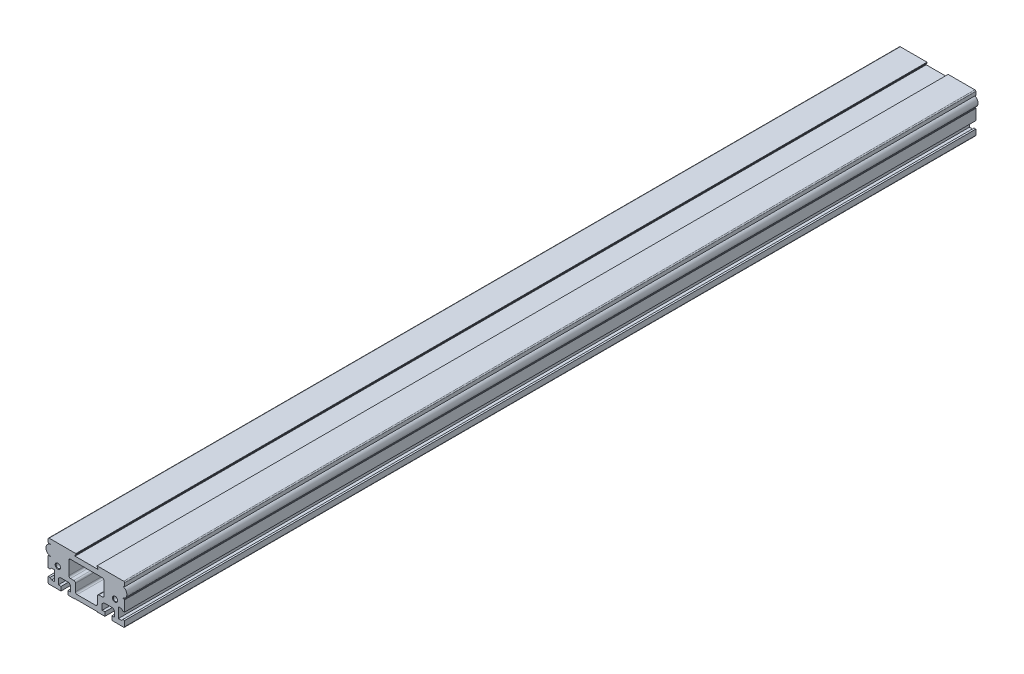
ISO-10303-21;
HEADER;
FILE_DESCRIPTION(('STEP AP214'),'2;1');
FILE_NAME('part.step','',(''),(''),'','','');
FILE_SCHEMA(('AUTOMOTIVE_DESIGN { 1 0 10303 214 1 1 1 1 }'));
ENDSEC;
DATA;
#1=APPLICATION_CONTEXT('core data for automotive mechanical design processes');
#2=APPLICATION_PROTOCOL_DEFINITION('international standard','automotive_design',2000,#1);
#3=PRODUCT_CONTEXT('',#1,'mechanical');
#4=PRODUCT('Part','Part','',(#3));
#5=PRODUCT_RELATED_PRODUCT_CATEGORY('part','',(#4));
#6=PRODUCT_DEFINITION_FORMATION('','',#4);
#7=PRODUCT_DEFINITION_CONTEXT('part definition',#1,'design');
#8=PRODUCT_DEFINITION('design','',#6,#7);
#9=PRODUCT_DEFINITION_SHAPE('','',#8);
#10=(LENGTH_UNIT() NAMED_UNIT(*) SI_UNIT(.MILLI.,.METRE.));
#11=(NAMED_UNIT(*) PLANE_ANGLE_UNIT() SI_UNIT($,.RADIAN.));
#12=(NAMED_UNIT(*) SI_UNIT($,.STERADIAN.) SOLID_ANGLE_UNIT());
#13=UNCERTAINTY_MEASURE_WITH_UNIT(LENGTH_MEASURE(1.E-05),#10,'distance_accuracy_value','');
#14=(GEOMETRIC_REPRESENTATION_CONTEXT(3) GLOBAL_UNCERTAINTY_ASSIGNED_CONTEXT((#13)) GLOBAL_UNIT_ASSIGNED_CONTEXT((#10,
#11,#12)) REPRESENTATION_CONTEXT('',''));
#15=CARTESIAN_POINT('',(0.,0.,0.));
#16=DIRECTION('',(0.,0.,1.));
#17=DIRECTION('',(1.,0.,0.));
#18=AXIS2_PLACEMENT_3D('',#15,#16,#17);
#19=CARTESIAN_POINT('',(56.,58.5,1280.));
#20=DIRECTION('',(0.,0.,1.));
#21=DIRECTION('',(1.,0.,0.));
#22=AXIS2_PLACEMENT_3D('',#19,#20,#21);
#23=PLANE('',#22);
#24=CARTESIAN_POINT('',(-43.,30.,1280.));
#25=DIRECTION('',(0.,0.,-1.));
#26=DIRECTION('',(-1.,0.,0.));
#27=AXIS2_PLACEMENT_3D('',#24,#25,#26);
#28=CIRCLE('',#27,4.);
#29=CARTESIAN_POINT('',(-47.,30.,1280.));
#30=VERTEX_POINT('',#29);
#31=EDGE_CURVE('E563',#30,#30,#28,.T.);
#32=ORIENTED_EDGE('',*,*,#31,.T.);
#33=EDGE_LOOP('',(#32));
#34=FACE_BOUND('',#33,.T.);
#35=DIRECTION('',(-0.500000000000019,0.866025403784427,0.));
#36=VECTOR('',#35,1.);
#37=CARTESIAN_POINT('',(17.0547005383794,57.,1280.));
#38=LINE('',#37,#36);
#39=CARTESIAN_POINT('',(17.0547005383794,57.,1280.));
#40=VERTEX_POINT('',#39);
#41=CARTESIAN_POINT('',(15.9,59.,1280.));
#42=VERTEX_POINT('',#41);
#43=EDGE_CURVE('E587',#40,#42,#38,.T.);
#44=ORIENTED_EDGE('',*,*,#43,.F.);
#45=DIRECTION('',(0.,-1.,0.));
#46=VECTOR('',#45,1.);
#47=CARTESIAN_POINT('',(17.0547005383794,57.,1280.));
#48=LINE('',#47,#46);
#49=CARTESIAN_POINT('',(17.0547005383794,56.,1280.));
#50=VERTEX_POINT('',#49);
#51=EDGE_CURVE('E858',#40,#50,#48,.T.);
#52=ORIENTED_EDGE('',*,*,#51,.T.);
#53=DIRECTION('',(1.,0.,0.));
#54=VECTOR('',#53,1.);
#55=CARTESIAN_POINT('',(-17.0552994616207,56.,1280.));
#56=LINE('',#55,#54);
#57=CARTESIAN_POINT('',(-17.0552994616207,56.,1280.));
#58=VERTEX_POINT('',#57);
#59=EDGE_CURVE('E862',#58,#50,#56,.T.);
#60=ORIENTED_EDGE('',*,*,#59,.F.);
#61=DIRECTION('',(0.,1.,0.));
#62=VECTOR('',#61,1.);
#63=CARTESIAN_POINT('',(-17.0552994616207,56.,1280.));
#64=LINE('',#63,#62);
#65=CARTESIAN_POINT('',(-17.0552994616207,57.,1280.));
#66=VERTEX_POINT('',#65);
#67=EDGE_CURVE('E866',#58,#66,#64,.T.);
#68=ORIENTED_EDGE('',*,*,#67,.T.);
#69=DIRECTION('',(-0.500194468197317,-0.865913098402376,0.));
#70=VECTOR('',#69,1.);
#71=CARTESIAN_POINT('',(-15.9,59.,1280.));
#72=LINE('',#71,#70);
#73=CARTESIAN_POINT('',(-15.9,59.,1280.));
#74=VERTEX_POINT('',#73);
#75=EDGE_CURVE('E869',#74,#66,#72,.T.);
#76=ORIENTED_EDGE('',*,*,#75,.F.);
#77=DIRECTION('',(0.,1.,0.));
#78=VECTOR('',#77,1.);
#79=CARTESIAN_POINT('',(-15.9,59.,1280.));
#80=LINE('',#79,#78);
#81=CARTESIAN_POINT('',(-15.9,60.,1280.));
#82=VERTEX_POINT('',#81);
#83=EDGE_CURVE('E873',#74,#82,#80,.T.);
#84=ORIENTED_EDGE('',*,*,#83,.T.);
#85=DIRECTION('',(1.,0.,0.));
#86=VECTOR('',#85,1.);
#87=CARTESIAN_POINT('',(-56.,60.,1280.));
#88=LINE('',#87,#86);
#89=CARTESIAN_POINT('',(-56.,60.,1280.));
#90=VERTEX_POINT('',#89);
#91=EDGE_CURVE('E876',#90,#82,#88,.T.);
#92=ORIENTED_EDGE('',*,*,#91,.F.);
#93=CARTESIAN_POINT('',(-56.,58.5,1280.));
#94=DIRECTION('',(0.,0.,1.));
#95=DIRECTION('',(1.,0.,0.));
#96=AXIS2_PLACEMENT_3D('',#93,#94,#95);
#97=CIRCLE('',#96,1.5);
#98=CARTESIAN_POINT('',(-57.5,58.5,1280.));
#99=VERTEX_POINT('',#98);
#100=EDGE_CURVE('E880',#90,#99,#97,.T.);
#101=ORIENTED_EDGE('',*,*,#100,.T.);
#102=DIRECTION('',(0.,1.,0.));
#103=VECTOR('',#102,1.);
#104=CARTESIAN_POINT('',(-57.5,53.425,1280.));
#105=LINE('',#104,#103);
#106=CARTESIAN_POINT('',(-57.5,53.425,1280.));
#107=VERTEX_POINT('',#106);
#108=EDGE_CURVE('E883',#107,#99,#105,.T.);
#109=ORIENTED_EDGE('',*,*,#108,.F.);
#110=DIRECTION('',(-0.707106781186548,0.707106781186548,0.));
#111=VECTOR('',#110,1.);
#112=CARTESIAN_POINT('',(-57.,52.925,1280.));
#113=LINE('',#112,#111);
#114=CARTESIAN_POINT('',(-57.,52.925,1280.));
#115=VERTEX_POINT('',#114);
#116=EDGE_CURVE('E887',#115,#107,#113,.T.);
#117=ORIENTED_EDGE('',*,*,#116,.F.);
#118=DIRECTION('',(-1.,0.,0.));
#119=VECTOR('',#118,1.);
#120=CARTESIAN_POINT('',(-52.9,52.925,1280.));
#121=LINE('',#120,#119);
#122=CARTESIAN_POINT('',(-52.9,52.925,1280.));
#123=VERTEX_POINT('',#122);
#124=EDGE_CURVE('E891',#123,#115,#121,.T.);
#125=ORIENTED_EDGE('',*,*,#124,.F.);
#126=CARTESIAN_POINT('',(-52.9,45.025,1280.));
#127=DIRECTION('',(0.,0.,1.));
#128=DIRECTION('',(1.,0.,0.));
#129=AXIS2_PLACEMENT_3D('',#126,#127,#128);
#130=CIRCLE('',#129,7.9);
#131=CARTESIAN_POINT('',(-52.9,37.125,1280.));
#132=VERTEX_POINT('',#131);
#133=EDGE_CURVE('E895',#123,#132,#130,.T.);
#134=ORIENTED_EDGE('',*,*,#133,.T.);
#135=DIRECTION('',(0.,-1.,0.));
#136=VECTOR('',#135,1.);
#137=CARTESIAN_POINT('',(-52.9,37.125,1280.));
#138=LINE('',#137,#136);
#139=CARTESIAN_POINT('',(-52.9,37.075,1280.));
#140=VERTEX_POINT('',#139);
#141=EDGE_CURVE('E898',#132,#140,#138,.T.);
#142=ORIENTED_EDGE('',*,*,#141,.T.);
#143=DIRECTION('',(1.,0.,0.));
#144=VECTOR('',#143,1.);
#145=CARTESIAN_POINT('',(-57.,37.075,1280.));
#146=LINE('',#145,#144);
#147=CARTESIAN_POINT('',(-57.,37.075,1280.));
#148=VERTEX_POINT('',#147);
#149=EDGE_CURVE('E901',#148,#140,#146,.T.);
#150=ORIENTED_EDGE('',*,*,#149,.F.);
#151=DIRECTION('',(0.707106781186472,0.707106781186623,0.));
#152=VECTOR('',#151,1.);
#153=CARTESIAN_POINT('',(-57.5,36.575,1280.));
#154=LINE('',#153,#152);
#155=CARTESIAN_POINT('',(-57.5,36.575,1280.));
#156=VERTEX_POINT('',#155);
#157=EDGE_CURVE('E905',#156,#148,#154,.T.);
#158=ORIENTED_EDGE('',*,*,#157,.F.);
#159=DIRECTION('',(0.,1.,0.));
#160=VECTOR('',#159,1.);
#161=CARTESIAN_POINT('',(-57.5,20.5,1280.));
#162=LINE('',#161,#160);
#163=CARTESIAN_POINT('',(-57.5,20.5,1280.));
#164=VERTEX_POINT('',#163);
#165=EDGE_CURVE('E909',#164,#156,#162,.T.);
#166=ORIENTED_EDGE('',*,*,#165,.F.);
#167=DIRECTION('',(-1.,0.,0.));
#168=VECTOR('',#167,1.);
#169=CARTESIAN_POINT('',(-54.75,20.5,1280.));
#170=LINE('',#169,#168);
#171=CARTESIAN_POINT('',(-54.75,20.5,1280.));
#172=VERTEX_POINT('',#171);
#173=EDGE_CURVE('E913',#172,#164,#170,.T.);
#174=ORIENTED_EDGE('',*,*,#173,.F.);
#175=DIRECTION('',(-0.707106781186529,-0.707106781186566,0.));
#176=VECTOR('',#175,1.);
#177=CARTESIAN_POINT('',(-52.5,22.75,1280.));
#178=LINE('',#177,#176);
#179=CARTESIAN_POINT('',(-52.5,22.75,1280.));
#180=VERTEX_POINT('',#179);
#181=EDGE_CURVE('E917',#180,#172,#178,.T.);
#182=ORIENTED_EDGE('',*,*,#181,.F.);
#183=DIRECTION('',(-1.,0.,0.));
#184=VECTOR('',#183,1.);
#185=CARTESIAN_POINT('',(-48.,22.75,1280.));
#186=LINE('',#185,#184);
#187=CARTESIAN_POINT('',(-48.,22.75,1280.));
#188=VERTEX_POINT('',#187);
#189=EDGE_CURVE('E921',#188,#180,#186,.T.);
#190=ORIENTED_EDGE('',*,*,#189,.F.);
#191=DIRECTION('',(0.,1.,0.));
#192=VECTOR('',#191,1.);
#193=CARTESIAN_POINT('',(-48.,7.25,1280.));
#194=LINE('',#193,#192);
#195=CARTESIAN_POINT('',(-48.,7.25,1280.));
#196=VERTEX_POINT('',#195);
#197=EDGE_CURVE('E925',#196,#188,#194,.T.);
#198=ORIENTED_EDGE('',*,*,#197,.F.);
#199=DIRECTION('',(1.,0.,0.));
#200=VECTOR('',#199,1.);
#201=CARTESIAN_POINT('',(-52.5,7.25,1280.));
#202=LINE('',#201,#200);
#203=CARTESIAN_POINT('',(-52.5,7.25,1280.));
#204=VERTEX_POINT('',#203);
#205=EDGE_CURVE('E929',#204,#196,#202,.T.);
#206=ORIENTED_EDGE('',*,*,#205,.F.);
#207=DIRECTION('',(0.707106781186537,-0.707106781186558,0.));
#208=VECTOR('',#207,1.);
#209=CARTESIAN_POINT('',(-54.75,9.50000000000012,1280.));
#210=LINE('',#209,#208);
#211=CARTESIAN_POINT('',(-54.75,9.50000000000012,1280.));
#212=VERTEX_POINT('',#211);
#213=EDGE_CURVE('E933',#212,#204,#210,.T.);
#214=ORIENTED_EDGE('',*,*,#213,.F.);
#215=DIRECTION('',(1.,0.,0.));
#216=VECTOR('',#215,1.);
#217=CARTESIAN_POINT('',(-57.5,9.50000000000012,1280.));
#218=LINE('',#217,#216);
#219=CARTESIAN_POINT('',(-57.5,9.50000000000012,1280.));
#220=VERTEX_POINT('',#219);
#221=EDGE_CURVE('E937',#220,#212,#218,.T.);
#222=ORIENTED_EDGE('',*,*,#221,.F.);
#223=DIRECTION('',(0.,1.,0.));
#224=VECTOR('',#223,1.);
#225=CARTESIAN_POINT('',(-57.5,1.49999999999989,1280.));
#226=LINE('',#225,#224);
#227=CARTESIAN_POINT('',(-57.5,1.49999999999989,1280.));
#228=VERTEX_POINT('',#227);
#229=EDGE_CURVE('E941',#228,#220,#226,.T.);
#230=ORIENTED_EDGE('',*,*,#229,.F.);
#231=CARTESIAN_POINT('',(-56.,1.49999999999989,1280.));
#232=DIRECTION('',(0.,0.,1.));
#233=DIRECTION('',(1.,0.,0.));
#234=AXIS2_PLACEMENT_3D('',#231,#232,#233);
#235=CIRCLE('',#234,1.5);
#236=CARTESIAN_POINT('',(-56.,-1.13797860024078E-13,1280.));
#237=VERTEX_POINT('',#236);
#238=EDGE_CURVE('E945',#228,#237,#235,.T.);
#239=ORIENTED_EDGE('',*,*,#238,.T.);
#240=DIRECTION('',(-1.,0.,0.));
#241=VECTOR('',#240,1.);
#242=CARTESIAN_POINT('',(-38.25,-1.13659082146E-13,1280.));
#243=LINE('',#242,#241);
#244=CARTESIAN_POINT('',(-38.25,-1.13659082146E-13,1280.));
#245=VERTEX_POINT('',#244);
#246=EDGE_CURVE('E948',#245,#237,#243,.T.);
#247=ORIENTED_EDGE('',*,*,#246,.F.);
#248=DIRECTION('',(0.,-1.,0.));
#249=VECTOR('',#248,1.);
#250=CARTESIAN_POINT('',(-38.25,6.,1280.));
#251=LINE('',#250,#249);
#252=CARTESIAN_POINT('',(-38.25,6.,1280.));
#253=VERTEX_POINT('',#252);
#254=EDGE_CURVE('E952',#253,#245,#251,.T.);
#255=ORIENTED_EDGE('',*,*,#254,.F.);
#256=DIRECTION('',(1.,0.,0.));
#257=VECTOR('',#256,1.);
#258=CARTESIAN_POINT('',(-42.25,6.,1280.));
#259=LINE('',#258,#257);
#260=CARTESIAN_POINT('',(-42.25,6.,1280.));
#261=VERTEX_POINT('',#260);
#262=EDGE_CURVE('E956',#261,#253,#259,.T.);
#263=ORIENTED_EDGE('',*,*,#262,.F.);
#264=DIRECTION('',(0.,-1.,0.));
#265=VECTOR('',#264,1.);
#266=CARTESIAN_POINT('',(-42.25,14.5000000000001,1280.));
#267=LINE('',#266,#265);
#268=CARTESIAN_POINT('',(-42.25,14.5000000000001,1280.));
#269=VERTEX_POINT('',#268);
#270=EDGE_CURVE('E960',#269,#261,#267,.T.);
#271=ORIENTED_EDGE('',*,*,#270,.F.);
#272=DIRECTION('',(-0.707106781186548,-0.707106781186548,0.));
#273=VECTOR('',#272,1.);
#274=CARTESIAN_POINT('',(-39.75,17.,1280.));
#275=LINE('',#274,#273);
#276=CARTESIAN_POINT('',(-39.75,17.,1280.));
#277=VERTEX_POINT('',#276);
#278=EDGE_CURVE('E964',#277,#269,#275,.T.);
#279=ORIENTED_EDGE('',*,*,#278,.F.);
#280=DIRECTION('',(-1.,0.,0.));
#281=VECTOR('',#280,1.);
#282=CARTESIAN_POINT('',(-26.25,17.,1280.));
#283=LINE('',#282,#281);
#284=CARTESIAN_POINT('',(-26.25,17.,1280.));
#285=VERTEX_POINT('',#284);
#286=EDGE_CURVE('E968',#285,#277,#283,.T.);
#287=ORIENTED_EDGE('',*,*,#286,.F.);
#288=DIRECTION('',(-0.707106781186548,0.707106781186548,0.));
#289=VECTOR('',#288,1.);
#290=CARTESIAN_POINT('',(-23.75,14.5000000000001,1280.));
#291=LINE('',#290,#289);
#292=CARTESIAN_POINT('',(-23.75,14.5000000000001,1280.));
#293=VERTEX_POINT('',#292);
#294=EDGE_CURVE('E972',#293,#285,#291,.T.);
#295=ORIENTED_EDGE('',*,*,#294,.F.);
#296=DIRECTION('',(0.,1.,0.));
#297=VECTOR('',#296,1.);
#298=CARTESIAN_POINT('',(-23.75,6.,1280.));
#299=LINE('',#298,#297);
#300=CARTESIAN_POINT('',(-23.75,6.,1280.));
#301=VERTEX_POINT('',#300);
#302=EDGE_CURVE('E976',#301,#293,#299,.T.);
#303=ORIENTED_EDGE('',*,*,#302,.F.);
#304=DIRECTION('',(1.,0.,0.));
#305=VECTOR('',#304,1.);
#306=CARTESIAN_POINT('',(-27.75,6.,1280.));
#307=LINE('',#306,#305);
#308=CARTESIAN_POINT('',(-27.75,6.,1280.));
#309=VERTEX_POINT('',#308);
#310=EDGE_CURVE('E980',#309,#301,#307,.T.);
#311=ORIENTED_EDGE('',*,*,#310,.F.);
#312=DIRECTION('',(0.,1.,0.));
#313=VECTOR('',#312,1.);
#314=CARTESIAN_POINT('',(-27.75,-1.70558012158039E-13,1280.));
#315=LINE('',#314,#313);
#316=CARTESIAN_POINT('',(-27.75,-1.70558012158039E-13,1280.));
#317=VERTEX_POINT('',#316);
#318=EDGE_CURVE('E984',#317,#309,#315,.T.);
#319=ORIENTED_EDGE('',*,*,#318,.F.);
#320=DIRECTION('',(-1.,0.,0.));
#321=VECTOR('',#320,1.);
#322=CARTESIAN_POINT('',(-17.,-1.13659082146E-13,1280.));
#323=LINE('',#322,#321);
#324=CARTESIAN_POINT('',(-17.,-1.13659082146E-13,1280.));
#325=VERTEX_POINT('',#324);
#326=EDGE_CURVE('E988',#325,#317,#323,.T.);
#327=ORIENTED_EDGE('',*,*,#326,.F.);
#328=DIRECTION('',(-0.707106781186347,-0.707106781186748,0.));
#329=VECTOR('',#328,1.);
#330=CARTESIAN_POINT('',(-16.5,0.5,1280.));
#331=LINE('',#330,#329);
#332=CARTESIAN_POINT('',(-16.5,0.5,1280.));
#333=VERTEX_POINT('',#332);
#334=EDGE_CURVE('E992',#333,#325,#331,.T.);
#335=ORIENTED_EDGE('',*,*,#334,.F.);
#336=DIRECTION('',(-1.,0.,0.));
#337=VECTOR('',#336,1.);
#338=CARTESIAN_POINT('',(16.5,0.5,1280.));
#339=LINE('',#338,#337);
#340=CARTESIAN_POINT('',(16.5,0.5,1280.));
#341=VERTEX_POINT('',#340);
#342=EDGE_CURVE('E996',#341,#333,#339,.T.);
#343=ORIENTED_EDGE('',*,*,#342,.F.);
#344=DIRECTION('',(-0.707106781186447,0.707106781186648,0.));
#345=VECTOR('',#344,1.);
#346=CARTESIAN_POINT('',(17.,-1.13659082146E-13,1280.));
#347=LINE('',#346,#345);
#348=CARTESIAN_POINT('',(17.,-1.13659082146E-13,1280.));
#349=VERTEX_POINT('',#348);
#350=EDGE_CURVE('E1000',#349,#341,#347,.T.);
#351=ORIENTED_EDGE('',*,*,#350,.F.);
#352=DIRECTION('',(-1.,0.,0.));
#353=VECTOR('',#352,1.);
#354=CARTESIAN_POINT('',(27.75,-1.13659082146E-13,1280.));
#355=LINE('',#354,#353);
#356=CARTESIAN_POINT('',(27.75,-1.13659082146E-13,1280.));
#357=VERTEX_POINT('',#356);
#358=EDGE_CURVE('E1004',#357,#349,#355,.T.);
#359=ORIENTED_EDGE('',*,*,#358,.F.);
#360=DIRECTION('',(0.,-1.,0.));
#361=VECTOR('',#360,1.);
#362=CARTESIAN_POINT('',(27.75,6.,1280.));
#363=LINE('',#362,#361);
#364=CARTESIAN_POINT('',(27.75,6.,1280.));
#365=VERTEX_POINT('',#364);
#366=EDGE_CURVE('E1008',#365,#357,#363,.T.);
#367=ORIENTED_EDGE('',*,*,#366,.F.);
#368=DIRECTION('',(1.,0.,0.));
#369=VECTOR('',#368,1.);
#370=CARTESIAN_POINT('',(23.75,6.,1280.));
#371=LINE('',#370,#369);
#372=CARTESIAN_POINT('',(23.75,6.,1280.));
#373=VERTEX_POINT('',#372);
#374=EDGE_CURVE('E1012',#373,#365,#371,.T.);
#375=ORIENTED_EDGE('',*,*,#374,.F.);
#376=DIRECTION('',(0.,-1.,0.));
#377=VECTOR('',#376,1.);
#378=CARTESIAN_POINT('',(23.75,14.5000000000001,1280.));
#379=LINE('',#378,#377);
#380=CARTESIAN_POINT('',(23.75,14.5000000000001,1280.));
#381=VERTEX_POINT('',#380);
#382=EDGE_CURVE('E1016',#381,#373,#379,.T.);
#383=ORIENTED_EDGE('',*,*,#382,.F.);
#384=DIRECTION('',(-0.707106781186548,-0.707106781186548,0.));
#385=VECTOR('',#384,1.);
#386=CARTESIAN_POINT('',(26.25,17.,1280.));
#387=LINE('',#386,#385);
#388=CARTESIAN_POINT('',(26.25,17.,1280.));
#389=VERTEX_POINT('',#388);
#390=EDGE_CURVE('E1020',#389,#381,#387,.T.);
#391=ORIENTED_EDGE('',*,*,#390,.F.);
#392=DIRECTION('',(-1.,0.,0.));
#393=VECTOR('',#392,1.);
#394=CARTESIAN_POINT('',(39.75,17.,1280.));
#395=LINE('',#394,#393);
#396=CARTESIAN_POINT('',(39.75,17.,1280.));
#397=VERTEX_POINT('',#396);
#398=EDGE_CURVE('E1024',#397,#389,#395,.T.);
#399=ORIENTED_EDGE('',*,*,#398,.F.);
#400=DIRECTION('',(-0.707106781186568,0.707106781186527,0.));
#401=VECTOR('',#400,1.);
#402=CARTESIAN_POINT('',(42.25,14.5000000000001,1280.));
#403=LINE('',#402,#401);
#404=CARTESIAN_POINT('',(42.25,14.5000000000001,1280.));
#405=VERTEX_POINT('',#404);
#406=EDGE_CURVE('E1028',#405,#397,#403,.T.);
#407=ORIENTED_EDGE('',*,*,#406,.F.);
#408=DIRECTION('',(0.,1.,0.));
#409=VECTOR('',#408,1.);
#410=CARTESIAN_POINT('',(42.25,6.,1280.));
#411=LINE('',#410,#409);
#412=CARTESIAN_POINT('',(42.25,6.,1280.));
#413=VERTEX_POINT('',#412);
#414=EDGE_CURVE('E1032',#413,#405,#411,.T.);
#415=ORIENTED_EDGE('',*,*,#414,.F.);
#416=DIRECTION('',(1.,0.,0.));
#417=VECTOR('',#416,1.);
#418=CARTESIAN_POINT('',(38.25,6.,1280.));
#419=LINE('',#418,#417);
#420=CARTESIAN_POINT('',(38.25,6.,1280.));
#421=VERTEX_POINT('',#420);
#422=EDGE_CURVE('E1036',#421,#413,#419,.T.);
#423=ORIENTED_EDGE('',*,*,#422,.F.);
#424=DIRECTION('',(0.,1.,0.));
#425=VECTOR('',#424,1.);
#426=CARTESIAN_POINT('',(38.25,-1.13659082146E-13,1280.));
#427=LINE('',#426,#425);
#428=CARTESIAN_POINT('',(38.25,-1.13659082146E-13,1280.));
#429=VERTEX_POINT('',#428);
#430=EDGE_CURVE('E1040',#429,#421,#427,.T.);
#431=ORIENTED_EDGE('',*,*,#430,.F.);
#432=DIRECTION('',(-1.,0.,0.));
#433=VECTOR('',#432,1.);
#434=CARTESIAN_POINT('',(56.,-1.13659082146E-13,1280.));
#435=LINE('',#434,#433);
#436=CARTESIAN_POINT('',(56.,-1.13659082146E-13,1280.));
#437=VERTEX_POINT('',#436);
#438=EDGE_CURVE('E1044',#437,#429,#435,.T.);
#439=ORIENTED_EDGE('',*,*,#438,.F.);
#440=CARTESIAN_POINT('',(56.,1.49999999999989,1280.));
#441=DIRECTION('',(0.,0.,1.));
#442=DIRECTION('',(1.,0.,0.));
#443=AXIS2_PLACEMENT_3D('',#440,#441,#442);
#444=CIRCLE('',#443,1.5);
#445=CARTESIAN_POINT('',(57.5,1.49999999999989,1280.));
#446=VERTEX_POINT('',#445);
#447=EDGE_CURVE('E1048',#437,#446,#444,.T.);
#448=ORIENTED_EDGE('',*,*,#447,.T.);
#449=DIRECTION('',(0.,-1.,0.));
#450=VECTOR('',#449,1.);
#451=CARTESIAN_POINT('',(57.5,9.50000000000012,1280.));
#452=LINE('',#451,#450);
#453=CARTESIAN_POINT('',(57.5,9.50000000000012,1280.));
#454=VERTEX_POINT('',#453);
#455=EDGE_CURVE('E1051',#454,#446,#452,.T.);
#456=ORIENTED_EDGE('',*,*,#455,.F.);
#457=DIRECTION('',(1.,0.,0.));
#458=VECTOR('',#457,1.);
#459=CARTESIAN_POINT('',(54.75,9.50000000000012,1280.));
#460=LINE('',#459,#458);
#461=CARTESIAN_POINT('',(54.75,9.50000000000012,1280.));
#462=VERTEX_POINT('',#461);
#463=EDGE_CURVE('E1055',#462,#454,#460,.T.);
#464=ORIENTED_EDGE('',*,*,#463,.F.);
#465=DIRECTION('',(0.707106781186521,0.707106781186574,0.));
#466=VECTOR('',#465,1.);
#467=CARTESIAN_POINT('',(52.5,7.25,1280.));
#468=LINE('',#467,#466);
#469=CARTESIAN_POINT('',(52.5,7.25,1280.));
#470=VERTEX_POINT('',#469);
#471=EDGE_CURVE('E1059',#470,#462,#468,.T.);
#472=ORIENTED_EDGE('',*,*,#471,.F.);
#473=DIRECTION('',(1.,0.,0.));
#474=VECTOR('',#473,1.);
#475=CARTESIAN_POINT('',(48.,7.25,1280.));
#476=LINE('',#475,#474);
#477=CARTESIAN_POINT('',(48.,7.25,1280.));
#478=VERTEX_POINT('',#477);
#479=EDGE_CURVE('E1063',#478,#470,#476,.T.);
#480=ORIENTED_EDGE('',*,*,#479,.F.);
#481=DIRECTION('',(0.,-1.,0.));
#482=VECTOR('',#481,1.);
#483=CARTESIAN_POINT('',(48.,22.75,1280.));
#484=LINE('',#483,#482);
#485=CARTESIAN_POINT('',(48.,22.75,1280.));
#486=VERTEX_POINT('',#485);
#487=EDGE_CURVE('E1067',#486,#478,#484,.T.);
#488=ORIENTED_EDGE('',*,*,#487,.F.);
#489=DIRECTION('',(-1.,0.,0.));
#490=VECTOR('',#489,1.);
#491=CARTESIAN_POINT('',(52.5,22.75,1280.));
#492=LINE('',#491,#490);
#493=CARTESIAN_POINT('',(52.5,22.75,1280.));
#494=VERTEX_POINT('',#493);
#495=EDGE_CURVE('E1071',#494,#486,#492,.T.);
#496=ORIENTED_EDGE('',*,*,#495,.F.);
#497=DIRECTION('',(-0.707106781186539,0.707106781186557,0.));
#498=VECTOR('',#497,1.);
#499=CARTESIAN_POINT('',(54.75,20.5,1280.));
#500=LINE('',#499,#498);
#501=CARTESIAN_POINT('',(54.75,20.5,1280.));
#502=VERTEX_POINT('',#501);
#503=EDGE_CURVE('E1075',#502,#494,#500,.T.);
#504=ORIENTED_EDGE('',*,*,#503,.F.);
#505=DIRECTION('',(-1.,0.,0.));
#506=VECTOR('',#505,1.);
#507=CARTESIAN_POINT('',(57.5,20.5,1280.));
#508=LINE('',#507,#506);
#509=CARTESIAN_POINT('',(57.5,20.5,1280.));
#510=VERTEX_POINT('',#509);
#511=EDGE_CURVE('E1079',#510,#502,#508,.T.);
#512=ORIENTED_EDGE('',*,*,#511,.F.);
#513=DIRECTION('',(0.,-1.,0.));
#514=VECTOR('',#513,1.);
#515=CARTESIAN_POINT('',(57.5,36.575,1280.));
#516=LINE('',#515,#514);
#517=CARTESIAN_POINT('',(57.5,36.575,1280.));
#518=VERTEX_POINT('',#517);
#519=EDGE_CURVE('E1083',#518,#510,#516,.T.);
#520=ORIENTED_EDGE('',*,*,#519,.F.);
#521=DIRECTION('',(0.707106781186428,-0.707106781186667,0.));
#522=VECTOR('',#521,1.);
#523=CARTESIAN_POINT('',(57.,37.075,1280.));
#524=LINE('',#523,#522);
#525=CARTESIAN_POINT('',(57.,37.075,1280.));
#526=VERTEX_POINT('',#525);
#527=EDGE_CURVE('E1087',#526,#518,#524,.T.);
#528=ORIENTED_EDGE('',*,*,#527,.F.);
#529=DIRECTION('',(1.,0.,0.));
#530=VECTOR('',#529,1.);
#531=CARTESIAN_POINT('',(52.9,37.075,1280.));
#532=LINE('',#531,#530);
#533=CARTESIAN_POINT('',(52.9,37.075,1280.));
#534=VERTEX_POINT('',#533);
#535=EDGE_CURVE('E1091',#534,#526,#532,.T.);
#536=ORIENTED_EDGE('',*,*,#535,.F.);
#537=DIRECTION('',(0.,-1.,0.));
#538=VECTOR('',#537,1.);
#539=CARTESIAN_POINT('',(52.9,37.125,1280.));
#540=LINE('',#539,#538);
#541=CARTESIAN_POINT('',(52.9,37.125,1280.));
#542=VERTEX_POINT('',#541);
#543=EDGE_CURVE('E1095',#542,#534,#540,.T.);
#544=ORIENTED_EDGE('',*,*,#543,.F.);
#545=CARTESIAN_POINT('',(52.9,45.025,1280.));
#546=DIRECTION('',(0.,0.,1.));
#547=DIRECTION('',(1.,0.,0.));
#548=AXIS2_PLACEMENT_3D('',#545,#546,#547);
#549=CIRCLE('',#548,7.9);
#550=CARTESIAN_POINT('',(52.9,52.925,1280.));
#551=VERTEX_POINT('',#550);
#552=EDGE_CURVE('E1099',#542,#551,#549,.T.);
#553=ORIENTED_EDGE('',*,*,#552,.T.);
#554=DIRECTION('',(-1.,0.,0.));
#555=VECTOR('',#554,1.);
#556=CARTESIAN_POINT('',(57.,52.925,1280.));
#557=LINE('',#556,#555);
#558=CARTESIAN_POINT('',(57.,52.925,1280.));
#559=VERTEX_POINT('',#558);
#560=EDGE_CURVE('E1102',#559,#551,#557,.T.);
#561=ORIENTED_EDGE('',*,*,#560,.F.);
#562=DIRECTION('',(-0.707106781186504,-0.707106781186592,0.));
#563=VECTOR('',#562,1.);
#564=CARTESIAN_POINT('',(57.5,53.425,1280.));
#565=LINE('',#564,#563);
#566=CARTESIAN_POINT('',(57.5,53.425,1280.));
#567=VERTEX_POINT('',#566);
#568=EDGE_CURVE('E1106',#567,#559,#565,.T.);
#569=ORIENTED_EDGE('',*,*,#568,.F.);
#570=DIRECTION('',(0.,-1.,0.));
#571=VECTOR('',#570,1.);
#572=CARTESIAN_POINT('',(57.5,58.5,1280.));
#573=LINE('',#572,#571);
#574=CARTESIAN_POINT('',(57.5,58.5,1280.));
#575=VERTEX_POINT('',#574);
#576=EDGE_CURVE('E1110',#575,#567,#573,.T.);
#577=ORIENTED_EDGE('',*,*,#576,.F.);
#578=CARTESIAN_POINT('',(56.,58.5,1280.));
#579=DIRECTION('',(0.,0.,1.));
#580=DIRECTION('',(1.,0.,0.));
#581=AXIS2_PLACEMENT_3D('',#578,#579,#580);
#582=CIRCLE('',#581,1.5);
#583=CARTESIAN_POINT('',(56.,60.,1280.));
#584=VERTEX_POINT('',#583);
#585=EDGE_CURVE('E1114',#575,#584,#582,.T.);
#586=ORIENTED_EDGE('',*,*,#585,.T.);
#587=DIRECTION('',(1.,0.,0.));
#588=VECTOR('',#587,1.);
#589=CARTESIAN_POINT('',(15.9,60.,1280.));
#590=LINE('',#589,#588);
#591=CARTESIAN_POINT('',(15.9,60.,1280.));
#592=VERTEX_POINT('',#591);
#593=EDGE_CURVE('E1117',#592,#584,#590,.T.);
#594=ORIENTED_EDGE('',*,*,#593,.F.);
#595=DIRECTION('',(0.,-1.,0.));
#596=VECTOR('',#595,1.);
#597=CARTESIAN_POINT('',(15.9,60.,1280.));
#598=LINE('',#597,#596);
#599=EDGE_CURVE('E1121',#592,#42,#598,.T.);
#600=ORIENTED_EDGE('',*,*,#599,.T.);
#601=EDGE_LOOP('',(#44,#52,#60,#68,#76,#84,#92,#101,#109,#117,#125,#134,#142,#150,#158,#166,
#174,#182,#190,#198,#206,#214,#222,#230,#239,#247,#255,#263,#271,#279,#287,#295,#303,#311,#319,
#327,#335,#343,#351,#359,#367,#375,#383,#391,#399,#407,#415,#423,#431,#439,#448,#456,#464,#472,
#480,#488,#496,#504,#512,#520,#528,#536,#544,#553,#561,#569,#577,#586,#594,#600));
#602=FACE_BOUND('',#601,.T.);
#603=CARTESIAN_POINT('',(-14.,10.,1280.));
#604=DIRECTION('',(0.,0.,1.));
#605=DIRECTION('',(1.,0.,0.));
#606=AXIS2_PLACEMENT_3D('',#603,#604,#605);
#607=CIRCLE('',#606,2.5);
#608=CARTESIAN_POINT('',(-14.,7.5,1280.));
#609=VERTEX_POINT('',#608);
#610=CARTESIAN_POINT('',(-16.5,10.,1280.));
#611=VERTEX_POINT('',#610);
#612=EDGE_CURVE('E568',#609,#611,#607,.F.);
#613=ORIENTED_EDGE('',*,*,#612,.T.);
#614=DIRECTION('',(0.,1.,0.));
#615=VECTOR('',#614,1.);
#616=CARTESIAN_POINT('',(-16.5,58.5,1280.));
#617=LINE('',#616,#615);
#618=CARTESIAN_POINT('',(-16.5,21.,1280.));
#619=VERTEX_POINT('',#618);
#620=EDGE_CURVE('E558',#611,#619,#617,.T.);
#621=ORIENTED_EDGE('',*,*,#620,.T.);
#622=CARTESIAN_POINT('',(-19.,21.,1280.));
#623=DIRECTION('',(0.,0.,1.));
#624=DIRECTION('',(1.,0.,0.));
#625=AXIS2_PLACEMENT_3D('',#622,#623,#624);
#626=CIRCLE('',#625,2.5);
#627=CARTESIAN_POINT('',(-19.,23.5,1280.));
#628=VERTEX_POINT('',#627);
#629=EDGE_CURVE('E546',#628,#619,#626,.F.);
#630=ORIENTED_EDGE('',*,*,#629,.F.);
#631=DIRECTION('',(-1.,0.,0.));
#632=VECTOR('',#631,1.);
#633=CARTESIAN_POINT('',(56.,23.5,1280.));
#634=LINE('',#633,#632);
#635=CARTESIAN_POINT('',(-24.,23.5,1280.));
#636=VERTEX_POINT('',#635);
#637=EDGE_CURVE('E552',#628,#636,#634,.T.);
#638=ORIENTED_EDGE('',*,*,#637,.T.);
#639=CARTESIAN_POINT('',(-24.,26.,1280.));
#640=DIRECTION('',(0.,0.,1.));
#641=DIRECTION('',(1.,0.,0.));
#642=AXIS2_PLACEMENT_3D('',#639,#640,#641);
#643=CIRCLE('',#642,2.5);
#644=CARTESIAN_POINT('',(-26.5,26.,1280.));
#645=VERTEX_POINT('',#644);
#646=EDGE_CURVE('E1457',#636,#645,#643,.F.);
#647=ORIENTED_EDGE('',*,*,#646,.T.);
#648=DIRECTION('',(0.,1.,0.));
#649=VECTOR('',#648,1.);
#650=CARTESIAN_POINT('',(-26.5,58.5,1280.));
#651=LINE('',#650,#649);
#652=CARTESIAN_POINT('',(-26.5,46.,1280.));
#653=VERTEX_POINT('',#652);
#654=EDGE_CURVE('E1461',#645,#653,#651,.T.);
#655=ORIENTED_EDGE('',*,*,#654,.T.);
#656=CARTESIAN_POINT('',(-24.,46.,1280.));
#657=DIRECTION('',(0.,0.,1.));
#658=DIRECTION('',(1.,0.,0.));
#659=AXIS2_PLACEMENT_3D('',#656,#657,#658);
#660=CIRCLE('',#659,2.5);
#661=CARTESIAN_POINT('',(-24.,48.5,1280.));
#662=VERTEX_POINT('',#661);
#663=EDGE_CURVE('E1465',#653,#662,#660,.F.);
#664=ORIENTED_EDGE('',*,*,#663,.T.);
#665=DIRECTION('',(1.,0.,0.));
#666=VECTOR('',#665,1.);
#667=CARTESIAN_POINT('',(56.,48.5,1280.));
#668=LINE('',#667,#666);
#669=CARTESIAN_POINT('',(24.,48.5,1280.));
#670=VERTEX_POINT('',#669);
#671=EDGE_CURVE('E1469',#662,#670,#668,.T.);
#672=ORIENTED_EDGE('',*,*,#671,.T.);
#673=CARTESIAN_POINT('',(24.,46.,1280.));
#674=DIRECTION('',(0.,0.,1.));
#675=DIRECTION('',(1.,0.,0.));
#676=AXIS2_PLACEMENT_3D('',#673,#674,#675);
#677=CIRCLE('',#676,2.5);
#678=CARTESIAN_POINT('',(26.5,46.,1280.));
#679=VERTEX_POINT('',#678);
#680=EDGE_CURVE('E1473',#670,#679,#677,.F.);
#681=ORIENTED_EDGE('',*,*,#680,.T.);
#682=DIRECTION('',(0.,-1.,0.));
#683=VECTOR('',#682,1.);
#684=CARTESIAN_POINT('',(26.5,58.5,1280.));
#685=LINE('',#684,#683);
#686=CARTESIAN_POINT('',(26.5,26.,1280.));
#687=VERTEX_POINT('',#686);
#688=EDGE_CURVE('E1477',#679,#687,#685,.T.);
#689=ORIENTED_EDGE('',*,*,#688,.T.);
#690=CARTESIAN_POINT('',(24.,26.,1280.));
#691=DIRECTION('',(0.,0.,1.));
#692=DIRECTION('',(1.,0.,0.));
#693=AXIS2_PLACEMENT_3D('',#690,#691,#692);
#694=CIRCLE('',#693,2.5);
#695=CARTESIAN_POINT('',(24.,23.5,1280.));
#696=VERTEX_POINT('',#695);
#697=EDGE_CURVE('E1481',#687,#696,#694,.F.);
#698=ORIENTED_EDGE('',*,*,#697,.T.);
#699=DIRECTION('',(-1.,0.,0.));
#700=VECTOR('',#699,1.);
#701=CARTESIAN_POINT('',(56.,23.5,1280.));
#702=LINE('',#701,#700);
#703=CARTESIAN_POINT('',(19.,23.5,1280.));
#704=VERTEX_POINT('',#703);
#705=EDGE_CURVE('E1485',#696,#704,#702,.T.);
#706=ORIENTED_EDGE('',*,*,#705,.T.);
#707=CARTESIAN_POINT('',(19.,21.,1280.));
#708=DIRECTION('',(0.,0.,1.));
#709=DIRECTION('',(1.,0.,0.));
#710=AXIS2_PLACEMENT_3D('',#707,#708,#709);
#711=CIRCLE('',#710,2.5);
#712=CARTESIAN_POINT('',(16.5,21.,1280.));
#713=VERTEX_POINT('',#712);
#714=EDGE_CURVE('E1489',#713,#704,#711,.F.);
#715=ORIENTED_EDGE('',*,*,#714,.F.);
#716=DIRECTION('',(0.,-1.,0.));
#717=VECTOR('',#716,1.);
#718=CARTESIAN_POINT('',(16.5,58.5,1280.));
#719=LINE('',#718,#717);
#720=CARTESIAN_POINT('',(16.5,10.,1280.));
#721=VERTEX_POINT('',#720);
#722=EDGE_CURVE('E1492',#713,#721,#719,.T.);
#723=ORIENTED_EDGE('',*,*,#722,.T.);
#724=CARTESIAN_POINT('',(14.,10.,1280.));
#725=DIRECTION('',(0.,0.,1.));
#726=DIRECTION('',(1.,0.,0.));
#727=AXIS2_PLACEMENT_3D('',#724,#725,#726);
#728=CIRCLE('',#727,2.5);
#729=CARTESIAN_POINT('',(14.,7.5,1280.));
#730=VERTEX_POINT('',#729);
#731=EDGE_CURVE('E1496',#721,#730,#728,.F.);
#732=ORIENTED_EDGE('',*,*,#731,.T.);
#733=DIRECTION('',(-1.,0.,0.));
#734=VECTOR('',#733,1.);
#735=CARTESIAN_POINT('',(56.,7.5,1280.));
#736=LINE('',#735,#734);
#737=EDGE_CURVE('E579',#730,#609,#736,.T.);
#738=ORIENTED_EDGE('',*,*,#737,.T.);
#739=EDGE_LOOP('',(#613,#621,#630,#638,#647,#655,#664,#672,#681,#689,#698,#706,#715,#723,#732,#738));
#740=FACE_BOUND('',#739,.T.);
#741=CARTESIAN_POINT('',(43.,30.,1280.));
#742=DIRECTION('',(0.,0.,-1.));
#743=DIRECTION('',(-1.,0.,0.));
#744=AXIS2_PLACEMENT_3D('',#741,#742,#743);
#745=CIRCLE('',#744,4.);
#746=CARTESIAN_POINT('',(39.,30.,1280.));
#747=VERTEX_POINT('',#746);
#748=EDGE_CURVE('E2546',#747,#747,#745,.T.);
#749=ORIENTED_EDGE('',*,*,#748,.T.);
#750=EDGE_LOOP('',(#749));
#751=FACE_BOUND('',#750,.T.);
#752=ADVANCED_FACE('F16',(#34,#602,#740,#751),#23,.T.);
#753=CARTESIAN_POINT('',(56.,58.5,0.));
#754=DIRECTION('',(0.,0.,1.));
#755=DIRECTION('',(1.,0.,0.));
#756=AXIS2_PLACEMENT_3D('',#753,#754,#755);
#757=PLANE('',#756);
#758=CARTESIAN_POINT('',(-43.,30.,0.));
#759=DIRECTION('',(0.,0.,-1.));
#760=DIRECTION('',(-1.,0.,0.));
#761=AXIS2_PLACEMENT_3D('',#758,#759,#760);
#762=CIRCLE('',#761,4.);
#763=CARTESIAN_POINT('',(-47.,30.,0.));
#764=VERTEX_POINT('',#763);
#765=EDGE_CURVE('E2554',#764,#764,#762,.T.);
#766=ORIENTED_EDGE('',*,*,#765,.F.);
#767=EDGE_LOOP('',(#766));
#768=FACE_BOUND('',#767,.T.);
#769=DIRECTION('',(-0.500000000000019,0.866025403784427,0.));
#770=VECTOR('',#769,1.);
#771=CARTESIAN_POINT('',(17.0547005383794,57.,0.));
#772=LINE('',#771,#770);
#773=CARTESIAN_POINT('',(17.0547005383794,57.,0.));
#774=VERTEX_POINT('',#773);
#775=CARTESIAN_POINT('',(15.9,59.,0.));
#776=VERTEX_POINT('',#775);
#777=EDGE_CURVE('E570',#774,#776,#772,.T.);
#778=ORIENTED_EDGE('',*,*,#777,.T.);
#779=DIRECTION('',(0.,-1.,0.));
#780=VECTOR('',#779,1.);
#781=CARTESIAN_POINT('',(15.9,60.,0.));
#782=LINE('',#781,#780);
#783=CARTESIAN_POINT('',(15.9,60.,0.));
#784=VERTEX_POINT('',#783);
#785=EDGE_CURVE('E577',#784,#776,#782,.T.);
#786=ORIENTED_EDGE('',*,*,#785,.F.);
#787=DIRECTION('',(1.,0.,0.));
#788=VECTOR('',#787,1.);
#789=CARTESIAN_POINT('',(15.9,60.,0.));
#790=LINE('',#789,#788);
#791=CARTESIAN_POINT('',(56.,60.,0.));
#792=VERTEX_POINT('',#791);
#793=EDGE_CURVE('E851',#784,#792,#790,.T.);
#794=ORIENTED_EDGE('',*,*,#793,.T.);
#795=CARTESIAN_POINT('',(56.,58.5,0.));
#796=DIRECTION('',(0.,0.,1.));
#797=DIRECTION('',(1.,0.,0.));
#798=AXIS2_PLACEMENT_3D('',#795,#796,#797);
#799=CIRCLE('',#798,1.5);
#800=CARTESIAN_POINT('',(57.5,58.5,0.));
#801=VERTEX_POINT('',#800);
#802=EDGE_CURVE('E847',#801,#792,#799,.T.);
#803=ORIENTED_EDGE('',*,*,#802,.F.);
#804=DIRECTION('',(0.,-1.,0.));
#805=VECTOR('',#804,1.);
#806=CARTESIAN_POINT('',(57.5,58.5,0.));
#807=LINE('',#806,#805);
#808=CARTESIAN_POINT('',(57.5,53.425,0.));
#809=VERTEX_POINT('',#808);
#810=EDGE_CURVE('E843',#801,#809,#807,.T.);
#811=ORIENTED_EDGE('',*,*,#810,.T.);
#812=DIRECTION('',(-0.707106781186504,-0.707106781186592,0.));
#813=VECTOR('',#812,1.);
#814=CARTESIAN_POINT('',(57.5,53.425,0.));
#815=LINE('',#814,#813);
#816=CARTESIAN_POINT('',(57.,52.925,0.));
#817=VERTEX_POINT('',#816);
#818=EDGE_CURVE('E839',#809,#817,#815,.T.);
#819=ORIENTED_EDGE('',*,*,#818,.T.);
#820=DIRECTION('',(-1.,0.,0.));
#821=VECTOR('',#820,1.);
#822=CARTESIAN_POINT('',(57.,52.925,0.));
#823=LINE('',#822,#821);
#824=CARTESIAN_POINT('',(52.9,52.925,0.));
#825=VERTEX_POINT('',#824);
#826=EDGE_CURVE('E835',#817,#825,#823,.T.);
#827=ORIENTED_EDGE('',*,*,#826,.T.);
#828=CARTESIAN_POINT('',(52.9,45.025,0.));
#829=DIRECTION('',(0.,0.,1.));
#830=DIRECTION('',(1.,0.,0.));
#831=AXIS2_PLACEMENT_3D('',#828,#829,#830);
#832=CIRCLE('',#831,7.9);
#833=CARTESIAN_POINT('',(52.9,37.125,0.));
#834=VERTEX_POINT('',#833);
#835=EDGE_CURVE('E831',#834,#825,#832,.T.);
#836=ORIENTED_EDGE('',*,*,#835,.F.);
#837=DIRECTION('',(0.,-1.,0.));
#838=VECTOR('',#837,1.);
#839=CARTESIAN_POINT('',(52.9,37.125,0.));
#840=LINE('',#839,#838);
#841=CARTESIAN_POINT('',(52.9,37.075,0.));
#842=VERTEX_POINT('',#841);
#843=EDGE_CURVE('E827',#834,#842,#840,.T.);
#844=ORIENTED_EDGE('',*,*,#843,.T.);
#845=DIRECTION('',(1.,0.,0.));
#846=VECTOR('',#845,1.);
#847=CARTESIAN_POINT('',(52.9,37.075,0.));
#848=LINE('',#847,#846);
#849=CARTESIAN_POINT('',(57.,37.075,0.));
#850=VERTEX_POINT('',#849);
#851=EDGE_CURVE('E823',#842,#850,#848,.T.);
#852=ORIENTED_EDGE('',*,*,#851,.T.);
#853=DIRECTION('',(0.707106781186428,-0.707106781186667,0.));
#854=VECTOR('',#853,1.);
#855=CARTESIAN_POINT('',(57.,37.075,0.));
#856=LINE('',#855,#854);
#857=CARTESIAN_POINT('',(57.5,36.575,0.));
#858=VERTEX_POINT('',#857);
#859=EDGE_CURVE('E819',#850,#858,#856,.T.);
#860=ORIENTED_EDGE('',*,*,#859,.T.);
#861=DIRECTION('',(0.,-1.,0.));
#862=VECTOR('',#861,1.);
#863=CARTESIAN_POINT('',(57.5,36.575,0.));
#864=LINE('',#863,#862);
#865=CARTESIAN_POINT('',(57.5,20.5,0.));
#866=VERTEX_POINT('',#865);
#867=EDGE_CURVE('E815',#858,#866,#864,.T.);
#868=ORIENTED_EDGE('',*,*,#867,.T.);
#869=DIRECTION('',(-1.,0.,0.));
#870=VECTOR('',#869,1.);
#871=CARTESIAN_POINT('',(57.5,20.5,0.));
#872=LINE('',#871,#870);
#873=CARTESIAN_POINT('',(54.75,20.5,0.));
#874=VERTEX_POINT('',#873);
#875=EDGE_CURVE('E811',#866,#874,#872,.T.);
#876=ORIENTED_EDGE('',*,*,#875,.T.);
#877=DIRECTION('',(-0.707106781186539,0.707106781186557,0.));
#878=VECTOR('',#877,1.);
#879=CARTESIAN_POINT('',(54.75,20.5,0.));
#880=LINE('',#879,#878);
#881=CARTESIAN_POINT('',(52.5,22.75,0.));
#882=VERTEX_POINT('',#881);
#883=EDGE_CURVE('E807',#874,#882,#880,.T.);
#884=ORIENTED_EDGE('',*,*,#883,.T.);
#885=DIRECTION('',(-1.,0.,0.));
#886=VECTOR('',#885,1.);
#887=CARTESIAN_POINT('',(52.5,22.75,0.));
#888=LINE('',#887,#886);
#889=CARTESIAN_POINT('',(48.,22.75,0.));
#890=VERTEX_POINT('',#889);
#891=EDGE_CURVE('E803',#882,#890,#888,.T.);
#892=ORIENTED_EDGE('',*,*,#891,.T.);
#893=DIRECTION('',(0.,-1.,0.));
#894=VECTOR('',#893,1.);
#895=CARTESIAN_POINT('',(48.,22.75,0.));
#896=LINE('',#895,#894);
#897=CARTESIAN_POINT('',(48.,7.25,0.));
#898=VERTEX_POINT('',#897);
#899=EDGE_CURVE('E799',#890,#898,#896,.T.);
#900=ORIENTED_EDGE('',*,*,#899,.T.);
#901=DIRECTION('',(1.,0.,0.));
#902=VECTOR('',#901,1.);
#903=CARTESIAN_POINT('',(48.,7.25,0.));
#904=LINE('',#903,#902);
#905=CARTESIAN_POINT('',(52.5,7.25,0.));
#906=VERTEX_POINT('',#905);
#907=EDGE_CURVE('E795',#898,#906,#904,.T.);
#908=ORIENTED_EDGE('',*,*,#907,.T.);
#909=DIRECTION('',(0.707106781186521,0.707106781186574,0.));
#910=VECTOR('',#909,1.);
#911=CARTESIAN_POINT('',(52.5,7.25,0.));
#912=LINE('',#911,#910);
#913=CARTESIAN_POINT('',(54.75,9.50000000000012,0.));
#914=VERTEX_POINT('',#913);
#915=EDGE_CURVE('E791',#906,#914,#912,.T.);
#916=ORIENTED_EDGE('',*,*,#915,.T.);
#917=DIRECTION('',(1.,0.,0.));
#918=VECTOR('',#917,1.);
#919=CARTESIAN_POINT('',(54.75,9.50000000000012,0.));
#920=LINE('',#919,#918);
#921=CARTESIAN_POINT('',(57.5,9.50000000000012,0.));
#922=VERTEX_POINT('',#921);
#923=EDGE_CURVE('E787',#914,#922,#920,.T.);
#924=ORIENTED_EDGE('',*,*,#923,.T.);
#925=DIRECTION('',(0.,-1.,0.));
#926=VECTOR('',#925,1.);
#927=CARTESIAN_POINT('',(57.5,9.50000000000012,0.));
#928=LINE('',#927,#926);
#929=CARTESIAN_POINT('',(57.5,1.49999999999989,0.));
#930=VERTEX_POINT('',#929);
#931=EDGE_CURVE('E783',#922,#930,#928,.T.);
#932=ORIENTED_EDGE('',*,*,#931,.T.);
#933=CARTESIAN_POINT('',(56.,1.49999999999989,0.));
#934=DIRECTION('',(0.,0.,1.));
#935=DIRECTION('',(1.,0.,0.));
#936=AXIS2_PLACEMENT_3D('',#933,#934,#935);
#937=CIRCLE('',#936,1.5);
#938=CARTESIAN_POINT('',(56.,-1.13659082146E-13,0.));
#939=VERTEX_POINT('',#938);
#940=EDGE_CURVE('E779',#939,#930,#937,.T.);
#941=ORIENTED_EDGE('',*,*,#940,.F.);
#942=DIRECTION('',(-1.,0.,0.));
#943=VECTOR('',#942,1.);
#944=CARTESIAN_POINT('',(56.,-1.13659082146E-13,0.));
#945=LINE('',#944,#943);
#946=CARTESIAN_POINT('',(38.25,-1.13659082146E-13,0.));
#947=VERTEX_POINT('',#946);
#948=EDGE_CURVE('E775',#939,#947,#945,.T.);
#949=ORIENTED_EDGE('',*,*,#948,.T.);
#950=DIRECTION('',(0.,1.,0.));
#951=VECTOR('',#950,1.);
#952=CARTESIAN_POINT('',(38.25,-1.13659082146E-13,0.));
#953=LINE('',#952,#951);
#954=CARTESIAN_POINT('',(38.25,6.,0.));
#955=VERTEX_POINT('',#954);
#956=EDGE_CURVE('E771',#947,#955,#953,.T.);
#957=ORIENTED_EDGE('',*,*,#956,.T.);
#958=DIRECTION('',(1.,0.,0.));
#959=VECTOR('',#958,1.);
#960=CARTESIAN_POINT('',(38.25,6.,0.));
#961=LINE('',#960,#959);
#962=CARTESIAN_POINT('',(42.25,6.,0.));
#963=VERTEX_POINT('',#962);
#964=EDGE_CURVE('E767',#955,#963,#961,.T.);
#965=ORIENTED_EDGE('',*,*,#964,.T.);
#966=DIRECTION('',(0.,1.,0.));
#967=VECTOR('',#966,1.);
#968=CARTESIAN_POINT('',(42.25,6.,0.));
#969=LINE('',#968,#967);
#970=CARTESIAN_POINT('',(42.25,14.5000000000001,0.));
#971=VERTEX_POINT('',#970);
#972=EDGE_CURVE('E763',#963,#971,#969,.T.);
#973=ORIENTED_EDGE('',*,*,#972,.T.);
#974=DIRECTION('',(-0.707106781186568,0.707106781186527,0.));
#975=VECTOR('',#974,1.);
#976=CARTESIAN_POINT('',(42.25,14.5000000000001,0.));
#977=LINE('',#976,#975);
#978=CARTESIAN_POINT('',(39.75,17.,0.));
#979=VERTEX_POINT('',#978);
#980=EDGE_CURVE('E759',#971,#979,#977,.T.);
#981=ORIENTED_EDGE('',*,*,#980,.T.);
#982=DIRECTION('',(-1.,0.,0.));
#983=VECTOR('',#982,1.);
#984=CARTESIAN_POINT('',(39.75,17.,0.));
#985=LINE('',#984,#983);
#986=CARTESIAN_POINT('',(26.25,17.,0.));
#987=VERTEX_POINT('',#986);
#988=EDGE_CURVE('E755',#979,#987,#985,.T.);
#989=ORIENTED_EDGE('',*,*,#988,.T.);
#990=DIRECTION('',(-0.707106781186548,-0.707106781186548,0.));
#991=VECTOR('',#990,1.);
#992=CARTESIAN_POINT('',(26.25,17.,0.));
#993=LINE('',#992,#991);
#994=CARTESIAN_POINT('',(23.75,14.5000000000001,0.));
#995=VERTEX_POINT('',#994);
#996=EDGE_CURVE('E751',#987,#995,#993,.T.);
#997=ORIENTED_EDGE('',*,*,#996,.T.);
#998=DIRECTION('',(0.,-1.,0.));
#999=VECTOR('',#998,1.);
#1000=CARTESIAN_POINT('',(23.75,14.5000000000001,0.));
#1001=LINE('',#1000,#999);
#1002=CARTESIAN_POINT('',(23.75,6.,0.));
#1003=VERTEX_POINT('',#1002);
#1004=EDGE_CURVE('E747',#995,#1003,#1001,.T.);
#1005=ORIENTED_EDGE('',*,*,#1004,.T.);
#1006=DIRECTION('',(1.,0.,0.));
#1007=VECTOR('',#1006,1.);
#1008=CARTESIAN_POINT('',(23.75,6.,0.));
#1009=LINE('',#1008,#1007);
#1010=CARTESIAN_POINT('',(27.75,6.,0.));
#1011=VERTEX_POINT('',#1010);
#1012=EDGE_CURVE('E743',#1003,#1011,#1009,.T.);
#1013=ORIENTED_EDGE('',*,*,#1012,.T.);
#1014=DIRECTION('',(0.,-1.,0.));
#1015=VECTOR('',#1014,1.);
#1016=CARTESIAN_POINT('',(27.75,6.,0.));
#1017=LINE('',#1016,#1015);
#1018=CARTESIAN_POINT('',(27.75,-1.13659082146E-13,0.));
#1019=VERTEX_POINT('',#1018);
#1020=EDGE_CURVE('E739',#1011,#1019,#1017,.T.);
#1021=ORIENTED_EDGE('',*,*,#1020,.T.);
#1022=DIRECTION('',(-1.,0.,0.));
#1023=VECTOR('',#1022,1.);
#1024=CARTESIAN_POINT('',(27.75,-1.13659082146E-13,0.));
#1025=LINE('',#1024,#1023);
#1026=CARTESIAN_POINT('',(17.,-1.13659082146E-13,0.));
#1027=VERTEX_POINT('',#1026);
#1028=EDGE_CURVE('E735',#1019,#1027,#1025,.T.);
#1029=ORIENTED_EDGE('',*,*,#1028,.T.);
#1030=DIRECTION('',(-0.707106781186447,0.707106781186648,0.));
#1031=VECTOR('',#1030,1.);
#1032=CARTESIAN_POINT('',(17.,-1.13659082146E-13,0.));
#1033=LINE('',#1032,#1031);
#1034=CARTESIAN_POINT('',(16.5,0.5,0.));
#1035=VERTEX_POINT('',#1034);
#1036=EDGE_CURVE('E731',#1027,#1035,#1033,.T.);
#1037=ORIENTED_EDGE('',*,*,#1036,.T.);
#1038=DIRECTION('',(-1.,0.,0.));
#1039=VECTOR('',#1038,1.);
#1040=CARTESIAN_POINT('',(16.5,0.5,0.));
#1041=LINE('',#1040,#1039);
#1042=CARTESIAN_POINT('',(-16.5,0.5,0.));
#1043=VERTEX_POINT('',#1042);
#1044=EDGE_CURVE('E727',#1035,#1043,#1041,.T.);
#1045=ORIENTED_EDGE('',*,*,#1044,.T.);
#1046=DIRECTION('',(-0.707106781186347,-0.707106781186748,0.));
#1047=VECTOR('',#1046,1.);
#1048=CARTESIAN_POINT('',(-16.5,0.5,0.));
#1049=LINE('',#1048,#1047);
#1050=CARTESIAN_POINT('',(-17.,-1.13659082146E-13,0.));
#1051=VERTEX_POINT('',#1050);
#1052=EDGE_CURVE('E723',#1043,#1051,#1049,.T.);
#1053=ORIENTED_EDGE('',*,*,#1052,.T.);
#1054=DIRECTION('',(-1.,0.,0.));
#1055=VECTOR('',#1054,1.);
#1056=CARTESIAN_POINT('',(-17.,-1.13659082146E-13,0.));
#1057=LINE('',#1056,#1055);
#1058=CARTESIAN_POINT('',(-27.75,-1.70558012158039E-13,0.));
#1059=VERTEX_POINT('',#1058);
#1060=EDGE_CURVE('E719',#1051,#1059,#1057,.T.);
#1061=ORIENTED_EDGE('',*,*,#1060,.T.);
#1062=DIRECTION('',(0.,1.,0.));
#1063=VECTOR('',#1062,1.);
#1064=CARTESIAN_POINT('',(-27.75,-1.70558012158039E-13,0.));
#1065=LINE('',#1064,#1063);
#1066=CARTESIAN_POINT('',(-27.75,6.,0.));
#1067=VERTEX_POINT('',#1066);
#1068=EDGE_CURVE('E715',#1059,#1067,#1065,.T.);
#1069=ORIENTED_EDGE('',*,*,#1068,.T.);
#1070=DIRECTION('',(1.,0.,0.));
#1071=VECTOR('',#1070,1.);
#1072=CARTESIAN_POINT('',(-27.75,6.,0.));
#1073=LINE('',#1072,#1071);
#1074=CARTESIAN_POINT('',(-23.75,6.,0.));
#1075=VERTEX_POINT('',#1074);
#1076=EDGE_CURVE('E711',#1067,#1075,#1073,.T.);
#1077=ORIENTED_EDGE('',*,*,#1076,.T.);
#1078=DIRECTION('',(0.,1.,0.));
#1079=VECTOR('',#1078,1.);
#1080=CARTESIAN_POINT('',(-23.75,6.,0.));
#1081=LINE('',#1080,#1079);
#1082=CARTESIAN_POINT('',(-23.75,14.5000000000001,0.));
#1083=VERTEX_POINT('',#1082);
#1084=EDGE_CURVE('E707',#1075,#1083,#1081,.T.);
#1085=ORIENTED_EDGE('',*,*,#1084,.T.);
#1086=DIRECTION('',(-0.707106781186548,0.707106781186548,0.));
#1087=VECTOR('',#1086,1.);
#1088=CARTESIAN_POINT('',(-23.75,14.5000000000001,0.));
#1089=LINE('',#1088,#1087);
#1090=CARTESIAN_POINT('',(-26.25,17.,0.));
#1091=VERTEX_POINT('',#1090);
#1092=EDGE_CURVE('E703',#1083,#1091,#1089,.T.);
#1093=ORIENTED_EDGE('',*,*,#1092,.T.);
#1094=DIRECTION('',(-1.,0.,0.));
#1095=VECTOR('',#1094,1.);
#1096=CARTESIAN_POINT('',(-26.25,17.,0.));
#1097=LINE('',#1096,#1095);
#1098=CARTESIAN_POINT('',(-39.75,17.,0.));
#1099=VERTEX_POINT('',#1098);
#1100=EDGE_CURVE('E699',#1091,#1099,#1097,.T.);
#1101=ORIENTED_EDGE('',*,*,#1100,.T.);
#1102=DIRECTION('',(-0.707106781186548,-0.707106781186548,0.));
#1103=VECTOR('',#1102,1.);
#1104=CARTESIAN_POINT('',(-39.75,17.,0.));
#1105=LINE('',#1104,#1103);
#1106=CARTESIAN_POINT('',(-42.25,14.5000000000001,0.));
#1107=VERTEX_POINT('',#1106);
#1108=EDGE_CURVE('E695',#1099,#1107,#1105,.T.);
#1109=ORIENTED_EDGE('',*,*,#1108,.T.);
#1110=DIRECTION('',(0.,-1.,0.));
#1111=VECTOR('',#1110,1.);
#1112=CARTESIAN_POINT('',(-42.25,14.5000000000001,0.));
#1113=LINE('',#1112,#1111);
#1114=CARTESIAN_POINT('',(-42.25,6.,0.));
#1115=VERTEX_POINT('',#1114);
#1116=EDGE_CURVE('E691',#1107,#1115,#1113,.T.);
#1117=ORIENTED_EDGE('',*,*,#1116,.T.);
#1118=DIRECTION('',(1.,0.,0.));
#1119=VECTOR('',#1118,1.);
#1120=CARTESIAN_POINT('',(-42.25,6.,0.));
#1121=LINE('',#1120,#1119);
#1122=CARTESIAN_POINT('',(-38.25,6.,0.));
#1123=VERTEX_POINT('',#1122);
#1124=EDGE_CURVE('E687',#1115,#1123,#1121,.T.);
#1125=ORIENTED_EDGE('',*,*,#1124,.T.);
#1126=DIRECTION('',(0.,-1.,0.));
#1127=VECTOR('',#1126,1.);
#1128=CARTESIAN_POINT('',(-38.25,6.,0.));
#1129=LINE('',#1128,#1127);
#1130=CARTESIAN_POINT('',(-38.25,-1.13659082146E-13,0.));
#1131=VERTEX_POINT('',#1130);
#1132=EDGE_CURVE('E683',#1123,#1131,#1129,.T.);
#1133=ORIENTED_EDGE('',*,*,#1132,.T.);
#1134=DIRECTION('',(-1.,0.,0.));
#1135=VECTOR('',#1134,1.);
#1136=CARTESIAN_POINT('',(-38.25,-1.13659082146E-13,0.));
#1137=LINE('',#1136,#1135);
#1138=CARTESIAN_POINT('',(-56.,-1.13797860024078E-13,0.));
#1139=VERTEX_POINT('',#1138);
#1140=EDGE_CURVE('E679',#1131,#1139,#1137,.T.);
#1141=ORIENTED_EDGE('',*,*,#1140,.T.);
#1142=CARTESIAN_POINT('',(-56.,1.49999999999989,0.));
#1143=DIRECTION('',(0.,0.,1.));
#1144=DIRECTION('',(1.,0.,0.));
#1145=AXIS2_PLACEMENT_3D('',#1142,#1143,#1144);
#1146=CIRCLE('',#1145,1.5);
#1147=CARTESIAN_POINT('',(-57.5,1.49999999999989,0.));
#1148=VERTEX_POINT('',#1147);
#1149=EDGE_CURVE('E675',#1148,#1139,#1146,.T.);
#1150=ORIENTED_EDGE('',*,*,#1149,.F.);
#1151=DIRECTION('',(0.,1.,0.));
#1152=VECTOR('',#1151,1.);
#1153=CARTESIAN_POINT('',(-57.5,1.49999999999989,0.));
#1154=LINE('',#1153,#1152);
#1155=CARTESIAN_POINT('',(-57.5,9.50000000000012,0.));
#1156=VERTEX_POINT('',#1155);
#1157=EDGE_CURVE('E671',#1148,#1156,#1154,.T.);
#1158=ORIENTED_EDGE('',*,*,#1157,.T.);
#1159=DIRECTION('',(1.,0.,0.));
#1160=VECTOR('',#1159,1.);
#1161=CARTESIAN_POINT('',(-57.5,9.50000000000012,0.));
#1162=LINE('',#1161,#1160);
#1163=CARTESIAN_POINT('',(-54.75,9.50000000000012,0.));
#1164=VERTEX_POINT('',#1163);
#1165=EDGE_CURVE('E667',#1156,#1164,#1162,.T.);
#1166=ORIENTED_EDGE('',*,*,#1165,.T.);
#1167=DIRECTION('',(0.707106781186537,-0.707106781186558,0.));
#1168=VECTOR('',#1167,1.);
#1169=CARTESIAN_POINT('',(-54.75,9.50000000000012,0.));
#1170=LINE('',#1169,#1168);
#1171=CARTESIAN_POINT('',(-52.5,7.25,0.));
#1172=VERTEX_POINT('',#1171);
#1173=EDGE_CURVE('E663',#1164,#1172,#1170,.T.);
#1174=ORIENTED_EDGE('',*,*,#1173,.T.);
#1175=DIRECTION('',(1.,0.,0.));
#1176=VECTOR('',#1175,1.);
#1177=CARTESIAN_POINT('',(-52.5,7.25,0.));
#1178=LINE('',#1177,#1176);
#1179=CARTESIAN_POINT('',(-48.,7.25,0.));
#1180=VERTEX_POINT('',#1179);
#1181=EDGE_CURVE('E659',#1172,#1180,#1178,.T.);
#1182=ORIENTED_EDGE('',*,*,#1181,.T.);
#1183=DIRECTION('',(0.,1.,0.));
#1184=VECTOR('',#1183,1.);
#1185=CARTESIAN_POINT('',(-48.,7.25,0.));
#1186=LINE('',#1185,#1184);
#1187=CARTESIAN_POINT('',(-48.,22.75,0.));
#1188=VERTEX_POINT('',#1187);
#1189=EDGE_CURVE('E655',#1180,#1188,#1186,.T.);
#1190=ORIENTED_EDGE('',*,*,#1189,.T.);
#1191=DIRECTION('',(-1.,0.,0.));
#1192=VECTOR('',#1191,1.);
#1193=CARTESIAN_POINT('',(-48.,22.75,0.));
#1194=LINE('',#1193,#1192);
#1195=CARTESIAN_POINT('',(-52.5,22.75,0.));
#1196=VERTEX_POINT('',#1195);
#1197=EDGE_CURVE('E651',#1188,#1196,#1194,.T.);
#1198=ORIENTED_EDGE('',*,*,#1197,.T.);
#1199=DIRECTION('',(-0.707106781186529,-0.707106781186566,0.));
#1200=VECTOR('',#1199,1.);
#1201=CARTESIAN_POINT('',(-52.5,22.75,0.));
#1202=LINE('',#1201,#1200);
#1203=CARTESIAN_POINT('',(-54.75,20.5,0.));
#1204=VERTEX_POINT('',#1203);
#1205=EDGE_CURVE('E647',#1196,#1204,#1202,.T.);
#1206=ORIENTED_EDGE('',*,*,#1205,.T.);
#1207=DIRECTION('',(-1.,0.,0.));
#1208=VECTOR('',#1207,1.);
#1209=CARTESIAN_POINT('',(-54.75,20.5,0.));
#1210=LINE('',#1209,#1208);
#1211=CARTESIAN_POINT('',(-57.5,20.5,0.));
#1212=VERTEX_POINT('',#1211);
#1213=EDGE_CURVE('E643',#1204,#1212,#1210,.T.);
#1214=ORIENTED_EDGE('',*,*,#1213,.T.);
#1215=DIRECTION('',(0.,1.,0.));
#1216=VECTOR('',#1215,1.);
#1217=CARTESIAN_POINT('',(-57.5,20.5,0.));
#1218=LINE('',#1217,#1216);
#1219=CARTESIAN_POINT('',(-57.5,36.575,0.));
#1220=VERTEX_POINT('',#1219);
#1221=EDGE_CURVE('E639',#1212,#1220,#1218,.T.);
#1222=ORIENTED_EDGE('',*,*,#1221,.T.);
#1223=DIRECTION('',(0.707106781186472,0.707106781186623,0.));
#1224=VECTOR('',#1223,1.);
#1225=CARTESIAN_POINT('',(-57.5,36.575,0.));
#1226=LINE('',#1225,#1224);
#1227=CARTESIAN_POINT('',(-57.,37.075,0.));
#1228=VERTEX_POINT('',#1227);
#1229=EDGE_CURVE('E635',#1220,#1228,#1226,.T.);
#1230=ORIENTED_EDGE('',*,*,#1229,.T.);
#1231=DIRECTION('',(1.,0.,0.));
#1232=VECTOR('',#1231,1.);
#1233=CARTESIAN_POINT('',(-57.,37.075,0.));
#1234=LINE('',#1233,#1232);
#1235=CARTESIAN_POINT('',(-52.9,37.075,0.));
#1236=VERTEX_POINT('',#1235);
#1237=EDGE_CURVE('E631',#1228,#1236,#1234,.T.);
#1238=ORIENTED_EDGE('',*,*,#1237,.T.);
#1239=DIRECTION('',(0.,-1.,0.));
#1240=VECTOR('',#1239,1.);
#1241=CARTESIAN_POINT('',(-52.9,37.125,0.));
#1242=LINE('',#1241,#1240);
#1243=CARTESIAN_POINT('',(-52.9,37.125,0.));
#1244=VERTEX_POINT('',#1243);
#1245=EDGE_CURVE('E627',#1244,#1236,#1242,.T.);
#1246=ORIENTED_EDGE('',*,*,#1245,.F.);
#1247=CARTESIAN_POINT('',(-52.9,45.025,0.));
#1248=DIRECTION('',(0.,0.,1.));
#1249=DIRECTION('',(1.,0.,0.));
#1250=AXIS2_PLACEMENT_3D('',#1247,#1248,#1249);
#1251=CIRCLE('',#1250,7.9);
#1252=CARTESIAN_POINT('',(-52.9,52.925,0.));
#1253=VERTEX_POINT('',#1252);
#1254=EDGE_CURVE('E624',#1253,#1244,#1251,.T.);
#1255=ORIENTED_EDGE('',*,*,#1254,.F.);
#1256=DIRECTION('',(-1.,0.,0.));
#1257=VECTOR('',#1256,1.);
#1258=CARTESIAN_POINT('',(-52.9,52.925,0.));
#1259=LINE('',#1258,#1257);
#1260=CARTESIAN_POINT('',(-57.,52.925,0.));
#1261=VERTEX_POINT('',#1260);
#1262=EDGE_CURVE('E620',#1253,#1261,#1259,.T.);
#1263=ORIENTED_EDGE('',*,*,#1262,.T.);
#1264=DIRECTION('',(-0.707106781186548,0.707106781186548,0.));
#1265=VECTOR('',#1264,1.);
#1266=CARTESIAN_POINT('',(-57.,52.925,0.));
#1267=LINE('',#1266,#1265);
#1268=CARTESIAN_POINT('',(-57.5,53.425,0.));
#1269=VERTEX_POINT('',#1268);
#1270=EDGE_CURVE('E616',#1261,#1269,#1267,.T.);
#1271=ORIENTED_EDGE('',*,*,#1270,.T.);
#1272=DIRECTION('',(0.,1.,0.));
#1273=VECTOR('',#1272,1.);
#1274=CARTESIAN_POINT('',(-57.5,53.425,0.));
#1275=LINE('',#1274,#1273);
#1276=CARTESIAN_POINT('',(-57.5,58.5,0.));
#1277=VERTEX_POINT('',#1276);
#1278=EDGE_CURVE('E612',#1269,#1277,#1275,.T.);
#1279=ORIENTED_EDGE('',*,*,#1278,.T.);
#1280=CARTESIAN_POINT('',(-56.,58.5,0.));
#1281=DIRECTION('',(0.,0.,1.));
#1282=DIRECTION('',(1.,0.,0.));
#1283=AXIS2_PLACEMENT_3D('',#1280,#1281,#1282);
#1284=CIRCLE('',#1283,1.5);
#1285=CARTESIAN_POINT('',(-56.,60.,0.));
#1286=VERTEX_POINT('',#1285);
#1287=EDGE_CURVE('E608',#1286,#1277,#1284,.T.);
#1288=ORIENTED_EDGE('',*,*,#1287,.F.);
#1289=DIRECTION('',(1.,0.,0.));
#1290=VECTOR('',#1289,1.);
#1291=CARTESIAN_POINT('',(-56.,60.,0.));
#1292=LINE('',#1291,#1290);
#1293=CARTESIAN_POINT('',(-15.9,60.,0.));
#1294=VERTEX_POINT('',#1293);
#1295=EDGE_CURVE('E604',#1286,#1294,#1292,.T.);
#1296=ORIENTED_EDGE('',*,*,#1295,.T.);
#1297=DIRECTION('',(0.,1.,0.));
#1298=VECTOR('',#1297,1.);
#1299=CARTESIAN_POINT('',(-15.9,59.,0.));
#1300=LINE('',#1299,#1298);
#1301=CARTESIAN_POINT('',(-15.9,59.,0.));
#1302=VERTEX_POINT('',#1301);
#1303=EDGE_CURVE('E600',#1302,#1294,#1300,.T.);
#1304=ORIENTED_EDGE('',*,*,#1303,.F.);
#1305=DIRECTION('',(-0.500194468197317,-0.865913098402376,0.));
#1306=VECTOR('',#1305,1.);
#1307=CARTESIAN_POINT('',(-15.9,59.,0.));
#1308=LINE('',#1307,#1306);
#1309=CARTESIAN_POINT('',(-17.0552994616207,57.,0.));
#1310=VERTEX_POINT('',#1309);
#1311=EDGE_CURVE('E596',#1302,#1310,#1308,.T.);
#1312=ORIENTED_EDGE('',*,*,#1311,.T.);
#1313=DIRECTION('',(0.,1.,0.));
#1314=VECTOR('',#1313,1.);
#1315=CARTESIAN_POINT('',(-17.0552994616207,56.,0.));
#1316=LINE('',#1315,#1314);
#1317=CARTESIAN_POINT('',(-17.0552994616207,56.,0.));
#1318=VERTEX_POINT('',#1317);
#1319=EDGE_CURVE('E592',#1318,#1310,#1316,.T.);
#1320=ORIENTED_EDGE('',*,*,#1319,.F.);
#1321=DIRECTION('',(1.,0.,0.));
#1322=VECTOR('',#1321,1.);
#1323=CARTESIAN_POINT('',(-17.0552994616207,56.,0.));
#1324=LINE('',#1323,#1322);
#1325=CARTESIAN_POINT('',(17.0547005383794,56.,0.));
#1326=VERTEX_POINT('',#1325);
#1327=EDGE_CURVE('E588',#1318,#1326,#1324,.T.);
#1328=ORIENTED_EDGE('',*,*,#1327,.T.);
#1329=DIRECTION('',(0.,-1.,0.));
#1330=VECTOR('',#1329,1.);
#1331=CARTESIAN_POINT('',(17.0547005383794,57.,0.));
#1332=LINE('',#1331,#1330);
#1333=EDGE_CURVE('E583',#774,#1326,#1332,.T.);
#1334=ORIENTED_EDGE('',*,*,#1333,.F.);
#1335=EDGE_LOOP('',(#778,#786,#794,#803,#811,#819,#827,#836,#844,#852,#860,#868,#876,#884,#892,
#900,#908,#916,#924,#932,#941,#949,#957,#965,#973,#981,#989,#997,#1005,#1013,#1021,#1029,#1037,
#1045,#1053,#1061,#1069,#1077,#1085,#1093,#1101,#1109,#1117,#1125,#1133,#1141,#1150,#1158,#1166,
#1174,#1182,#1190,#1198,#1206,#1214,#1222,#1230,#1238,#1246,#1255,#1263,#1271,#1279,#1288,#1296,
#1304,#1312,#1320,#1328,#1334));
#1336=FACE_BOUND('',#1335,.T.);
#1337=DIRECTION('',(0.,1.,0.));
#1338=VECTOR('',#1337,1.);
#1339=CARTESIAN_POINT('',(-16.5,58.5,0.));
#1340=LINE('',#1339,#1338);
#1341=CARTESIAN_POINT('',(-16.5,10.,0.));
#1342=VERTEX_POINT('',#1341);
#1343=CARTESIAN_POINT('',(-16.5,21.,0.));
#1344=VERTEX_POINT('',#1343);
#1345=EDGE_CURVE('E11',#1342,#1344,#1340,.T.);
#1346=ORIENTED_EDGE('',*,*,#1345,.F.);
#1347=CARTESIAN_POINT('',(-14.,10.,0.));
#1348=DIRECTION('',(0.,0.,1.));
#1349=DIRECTION('',(1.,0.,0.));
#1350=AXIS2_PLACEMENT_3D('',#1347,#1348,#1349);
#1351=CIRCLE('',#1350,2.5);
#1352=CARTESIAN_POINT('',(-14.,7.5,0.));
#1353=VERTEX_POINT('',#1352);
#1354=EDGE_CURVE('E25',#1353,#1342,#1351,.F.);
#1355=ORIENTED_EDGE('',*,*,#1354,.F.);
#1356=DIRECTION('',(-1.,0.,0.));
#1357=VECTOR('',#1356,1.);
#1358=CARTESIAN_POINT('',(56.,7.5,0.));
#1359=LINE('',#1358,#1357);
#1360=CARTESIAN_POINT('',(14.,7.5,0.));
#1361=VERTEX_POINT('',#1360);
#1362=EDGE_CURVE('E1377',#1361,#1353,#1359,.T.);
#1363=ORIENTED_EDGE('',*,*,#1362,.F.);
#1364=CARTESIAN_POINT('',(14.,10.,0.));
#1365=DIRECTION('',(0.,0.,1.));
#1366=DIRECTION('',(1.,0.,0.));
#1367=AXIS2_PLACEMENT_3D('',#1364,#1365,#1366);
#1368=CIRCLE('',#1367,2.5);
#1369=CARTESIAN_POINT('',(16.5,10.,0.));
#1370=VERTEX_POINT('',#1369);
#1371=EDGE_CURVE('E1374',#1370,#1361,#1368,.F.);
#1372=ORIENTED_EDGE('',*,*,#1371,.F.);
#1373=DIRECTION('',(0.,-1.,0.));
#1374=VECTOR('',#1373,1.);
#1375=CARTESIAN_POINT('',(16.5,58.5,0.));
#1376=LINE('',#1375,#1374);
#1377=CARTESIAN_POINT('',(16.5,21.,0.));
#1378=VERTEX_POINT('',#1377);
#1379=EDGE_CURVE('E1371',#1378,#1370,#1376,.T.);
#1380=ORIENTED_EDGE('',*,*,#1379,.F.);
#1381=CARTESIAN_POINT('',(19.,21.,0.));
#1382=DIRECTION('',(0.,0.,1.));
#1383=DIRECTION('',(1.,0.,0.));
#1384=AXIS2_PLACEMENT_3D('',#1381,#1382,#1383);
#1385=CIRCLE('',#1384,2.5);
#1386=CARTESIAN_POINT('',(19.,23.5,0.));
#1387=VERTEX_POINT('',#1386);
#1388=EDGE_CURVE('E1367',#1378,#1387,#1385,.F.);
#1389=ORIENTED_EDGE('',*,*,#1388,.T.);
#1390=DIRECTION('',(-1.,0.,0.));
#1391=VECTOR('',#1390,1.);
#1392=CARTESIAN_POINT('',(56.,23.5,0.));
#1393=LINE('',#1392,#1391);
#1394=CARTESIAN_POINT('',(24.,23.5,0.));
#1395=VERTEX_POINT('',#1394);
#1396=EDGE_CURVE('E1364',#1395,#1387,#1393,.T.);
#1397=ORIENTED_EDGE('',*,*,#1396,.F.);
#1398=CARTESIAN_POINT('',(24.,26.,0.));
#1399=DIRECTION('',(0.,0.,1.));
#1400=DIRECTION('',(1.,0.,0.));
#1401=AXIS2_PLACEMENT_3D('',#1398,#1399,#1400);
#1402=CIRCLE('',#1401,2.5);
#1403=CARTESIAN_POINT('',(26.5,26.,0.));
#1404=VERTEX_POINT('',#1403);
#1405=EDGE_CURVE('E1361',#1404,#1395,#1402,.F.);
#1406=ORIENTED_EDGE('',*,*,#1405,.F.);
#1407=DIRECTION('',(0.,-1.,0.));
#1408=VECTOR('',#1407,1.);
#1409=CARTESIAN_POINT('',(26.5,58.5,0.));
#1410=LINE('',#1409,#1408);
#1411=CARTESIAN_POINT('',(26.5,46.,0.));
#1412=VERTEX_POINT('',#1411);
#1413=EDGE_CURVE('E1358',#1412,#1404,#1410,.T.);
#1414=ORIENTED_EDGE('',*,*,#1413,.F.);
#1415=CARTESIAN_POINT('',(24.,46.,0.));
#1416=DIRECTION('',(0.,0.,1.));
#1417=DIRECTION('',(1.,0.,0.));
#1418=AXIS2_PLACEMENT_3D('',#1415,#1416,#1417);
#1419=CIRCLE('',#1418,2.5);
#1420=CARTESIAN_POINT('',(24.,48.5,0.));
#1421=VERTEX_POINT('',#1420);
#1422=EDGE_CURVE('E1355',#1421,#1412,#1419,.F.);
#1423=ORIENTED_EDGE('',*,*,#1422,.F.);
#1424=DIRECTION('',(1.,0.,0.));
#1425=VECTOR('',#1424,1.);
#1426=CARTESIAN_POINT('',(56.,48.5,0.));
#1427=LINE('',#1426,#1425);
#1428=CARTESIAN_POINT('',(-24.,48.5,0.));
#1429=VERTEX_POINT('',#1428);
#1430=EDGE_CURVE('E1352',#1429,#1421,#1427,.T.);
#1431=ORIENTED_EDGE('',*,*,#1430,.F.);
#1432=CARTESIAN_POINT('',(-24.,46.,0.));
#1433=DIRECTION('',(0.,0.,1.));
#1434=DIRECTION('',(1.,0.,0.));
#1435=AXIS2_PLACEMENT_3D('',#1432,#1433,#1434);
#1436=CIRCLE('',#1435,2.5);
#1437=CARTESIAN_POINT('',(-26.5,46.,0.));
#1438=VERTEX_POINT('',#1437);
#1439=EDGE_CURVE('E1349',#1438,#1429,#1436,.F.);
#1440=ORIENTED_EDGE('',*,*,#1439,.F.);
#1441=DIRECTION('',(0.,1.,0.));
#1442=VECTOR('',#1441,1.);
#1443=CARTESIAN_POINT('',(-26.5,58.5,0.));
#1444=LINE('',#1443,#1442);
#1445=CARTESIAN_POINT('',(-26.5,26.,0.));
#1446=VERTEX_POINT('',#1445);
#1447=EDGE_CURVE('E1346',#1446,#1438,#1444,.T.);
#1448=ORIENTED_EDGE('',*,*,#1447,.F.);
#1449=CARTESIAN_POINT('',(-24.,26.,0.));
#1450=DIRECTION('',(0.,0.,1.));
#1451=DIRECTION('',(1.,0.,0.));
#1452=AXIS2_PLACEMENT_3D('',#1449,#1450,#1451);
#1453=CIRCLE('',#1452,2.5);
#1454=CARTESIAN_POINT('',(-24.,23.5,0.));
#1455=VERTEX_POINT('',#1454);
#1456=EDGE_CURVE('E1343',#1455,#1446,#1453,.F.);
#1457=ORIENTED_EDGE('',*,*,#1456,.F.);
#1458=DIRECTION('',(-1.,0.,0.));
#1459=VECTOR('',#1458,1.);
#1460=CARTESIAN_POINT('',(56.,23.5,0.));
#1461=LINE('',#1460,#1459);
#1462=CARTESIAN_POINT('',(-19.,23.5,0.));
#1463=VERTEX_POINT('',#1462);
#1464=EDGE_CURVE('E1340',#1463,#1455,#1461,.T.);
#1465=ORIENTED_EDGE('',*,*,#1464,.F.);
#1466=CARTESIAN_POINT('',(-19.,21.,0.));
#1467=DIRECTION('',(0.,0.,1.));
#1468=DIRECTION('',(1.,0.,0.));
#1469=AXIS2_PLACEMENT_3D('',#1466,#1467,#1468);
#1470=CIRCLE('',#1469,2.5);
#1471=EDGE_CURVE('E1337',#1463,#1344,#1470,.F.);
#1472=ORIENTED_EDGE('',*,*,#1471,.T.);
#1473=EDGE_LOOP('',(#1346,#1355,#1363,#1372,#1380,#1389,#1397,#1406,#1414,#1423,#1431,#1440,
#1448,#1457,#1465,#1472));
#1474=FACE_BOUND('',#1473,.T.);
#1475=CARTESIAN_POINT('',(43.,30.,0.));
#1476=DIRECTION('',(0.,0.,-1.));
#1477=DIRECTION('',(-1.,0.,0.));
#1478=AXIS2_PLACEMENT_3D('',#1475,#1476,#1477);
#1479=CIRCLE('',#1478,4.);
#1480=CARTESIAN_POINT('',(39.,30.,0.));
#1481=VERTEX_POINT('',#1480);
#1482=EDGE_CURVE('E2542',#1481,#1481,#1479,.T.);
#1483=ORIENTED_EDGE('',*,*,#1482,.F.);
#1484=EDGE_LOOP('',(#1483));
#1485=FACE_BOUND('',#1484,.T.);
#1486=ADVANCED_FACE('F1391',(#768,#1336,#1474,#1485),#757,.F.);
#1487=CARTESIAN_POINT('',(17.0547005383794,57.,1280.));
#1488=DIRECTION('',(-0.866025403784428,-0.500000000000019,0.));
#1489=DIRECTION('',(0.500000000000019,-0.866025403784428,0.));
#1490=AXIS2_PLACEMENT_3D('',#1487,#1488,#1489);
#1491=PLANE('',#1490);
#1492=ORIENTED_EDGE('',*,*,#777,.F.);
#1493=DIRECTION('',(0.,0.,-1.));
#1494=VECTOR('',#1493,1.);
#1495=CARTESIAN_POINT('',(17.0547005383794,57.,1280.));
#1496=LINE('',#1495,#1494);
#1497=EDGE_CURVE('E1334',#40,#774,#1496,.T.);
#1498=ORIENTED_EDGE('',*,*,#1497,.F.);
#1499=ORIENTED_EDGE('',*,*,#43,.T.);
#1500=DIRECTION('',(0.,0.,-1.));
#1501=VECTOR('',#1500,1.);
#1502=CARTESIAN_POINT('',(15.9,59.,1280.));
#1503=LINE('',#1502,#1501);
#1504=EDGE_CURVE('E861',#42,#776,#1503,.T.);
#1505=ORIENTED_EDGE('',*,*,#1504,.T.);
#1506=EDGE_LOOP('',(#1492,#1498,#1499,#1505));
#1507=FACE_BOUND('',#1506,.T.);
#1508=ADVANCED_FACE('F18',(#1507),#1491,.T.);
#1509=CARTESIAN_POINT('',(17.0547005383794,57.,1280.));
#1510=DIRECTION('',(1.,0.,0.));
#1511=DIRECTION('',(0.,0.,-1.));
#1512=AXIS2_PLACEMENT_3D('',#1509,#1510,#1511);
#1513=PLANE('',#1512);
#1514=ORIENTED_EDGE('',*,*,#1333,.T.);
#1515=DIRECTION('',(0.,0.,-1.));
#1516=VECTOR('',#1515,1.);
#1517=CARTESIAN_POINT('',(17.0547005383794,56.,1280.));
#1518=LINE('',#1517,#1516);
#1519=EDGE_CURVE('E1331',#50,#1326,#1518,.T.);
#1520=ORIENTED_EDGE('',*,*,#1519,.F.);
#1521=ORIENTED_EDGE('',*,*,#51,.F.);
#1522=ORIENTED_EDGE('',*,*,#1497,.T.);
#1523=EDGE_LOOP('',(#1514,#1520,#1521,#1522));
#1524=FACE_BOUND('',#1523,.T.);
#1525=ADVANCED_FACE('F1568',(#1524),#1513,.F.);
#1526=CARTESIAN_POINT('',(-17.0552994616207,56.,1280.));
#1527=DIRECTION('',(0.,1.,0.));
#1528=DIRECTION('',(0.,0.,1.));
#1529=AXIS2_PLACEMENT_3D('',#1526,#1527,#1528);
#1530=PLANE('',#1529);
#1531=ORIENTED_EDGE('',*,*,#1327,.F.);
#1532=DIRECTION('',(0.,0.,-1.));
#1533=VECTOR('',#1532,1.);
#1534=CARTESIAN_POINT('',(-17.0552994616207,56.,1280.));
#1535=LINE('',#1534,#1533);
#1536=EDGE_CURVE('E1328',#58,#1318,#1535,.T.);
#1537=ORIENTED_EDGE('',*,*,#1536,.F.);
#1538=ORIENTED_EDGE('',*,*,#59,.T.);
#1539=ORIENTED_EDGE('',*,*,#1519,.T.);
#1540=EDGE_LOOP('',(#1531,#1537,#1538,#1539));
#1541=FACE_BOUND('',#1540,.T.);
#1542=ADVANCED_FACE('F1571',(#1541),#1530,.T.);
#1543=CARTESIAN_POINT('',(-17.0552994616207,56.,1280.));
#1544=DIRECTION('',(-1.,0.,0.));
#1545=DIRECTION('',(0.,0.,1.));
#1546=AXIS2_PLACEMENT_3D('',#1543,#1544,#1545);
#1547=PLANE('',#1546);
#1548=ORIENTED_EDGE('',*,*,#1319,.T.);
#1549=DIRECTION('',(0.,0.,-1.));
#1550=VECTOR('',#1549,1.);
#1551=CARTESIAN_POINT('',(-17.0552994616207,57.,1280.));
#1552=LINE('',#1551,#1550);
#1553=EDGE_CURVE('E1325',#66,#1310,#1552,.T.);
#1554=ORIENTED_EDGE('',*,*,#1553,.F.);
#1555=ORIENTED_EDGE('',*,*,#67,.F.);
#1556=ORIENTED_EDGE('',*,*,#1536,.T.);
#1557=EDGE_LOOP('',(#1548,#1554,#1555,#1556));
#1558=FACE_BOUND('',#1557,.T.);
#1559=ADVANCED_FACE('F1575',(#1558),#1547,.F.);
#1560=CARTESIAN_POINT('',(-15.9,59.,1280.));
#1561=DIRECTION('',(0.865913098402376,-0.500194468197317,0.));
#1562=DIRECTION('',(0.500194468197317,0.865913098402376,0.));
#1563=AXIS2_PLACEMENT_3D('',#1560,#1561,#1562);
#1564=PLANE('',#1563);
#1565=ORIENTED_EDGE('',*,*,#1311,.F.);
#1566=DIRECTION('',(0.,0.,-1.));
#1567=VECTOR('',#1566,1.);
#1568=CARTESIAN_POINT('',(-15.9,59.,1280.));
#1569=LINE('',#1568,#1567);
#1570=EDGE_CURVE('E1322',#74,#1302,#1569,.T.);
#1571=ORIENTED_EDGE('',*,*,#1570,.F.);
#1572=ORIENTED_EDGE('',*,*,#75,.T.);
#1573=ORIENTED_EDGE('',*,*,#1553,.T.);
#1574=EDGE_LOOP('',(#1565,#1571,#1572,#1573));
#1575=FACE_BOUND('',#1574,.T.);
#1576=ADVANCED_FACE('F1579',(#1575),#1564,.T.);
#1577=CARTESIAN_POINT('',(-15.9,59.,1280.));
#1578=DIRECTION('',(-1.,0.,0.));
#1579=DIRECTION('',(0.,0.,1.));
#1580=AXIS2_PLACEMENT_3D('',#1577,#1578,#1579);
#1581=PLANE('',#1580);
#1582=ORIENTED_EDGE('',*,*,#1303,.T.);
#1583=DIRECTION('',(0.,0.,-1.));
#1584=VECTOR('',#1583,1.);
#1585=CARTESIAN_POINT('',(-15.9,60.,1280.));
#1586=LINE('',#1585,#1584);
#1587=EDGE_CURVE('E1319',#82,#1294,#1586,.T.);
#1588=ORIENTED_EDGE('',*,*,#1587,.F.);
#1589=ORIENTED_EDGE('',*,*,#83,.F.);
#1590=ORIENTED_EDGE('',*,*,#1570,.T.);
#1591=EDGE_LOOP('',(#1582,#1588,#1589,#1590));
#1592=FACE_BOUND('',#1591,.T.);
#1593=ADVANCED_FACE('F1583',(#1592),#1581,.F.);
#1594=CARTESIAN_POINT('',(-56.,60.,1280.));
#1595=DIRECTION('',(0.,1.,0.));
#1596=DIRECTION('',(0.,0.,1.));
#1597=AXIS2_PLACEMENT_3D('',#1594,#1595,#1596);
#1598=PLANE('',#1597);
#1599=ORIENTED_EDGE('',*,*,#1295,.F.);
#1600=DIRECTION('',(0.,0.,-1.));
#1601=VECTOR('',#1600,1.);
#1602=CARTESIAN_POINT('',(-56.,60.,1280.));
#1603=LINE('',#1602,#1601);
#1604=EDGE_CURVE('E1316',#90,#1286,#1603,.T.);
#1605=ORIENTED_EDGE('',*,*,#1604,.F.);
#1606=ORIENTED_EDGE('',*,*,#91,.T.);
#1607=ORIENTED_EDGE('',*,*,#1587,.T.);
#1608=EDGE_LOOP('',(#1599,#1605,#1606,#1607));
#1609=FACE_BOUND('',#1608,.T.);
#1610=ADVANCED_FACE('F1587',(#1609),#1598,.T.);
#1611=CARTESIAN_POINT('',(-56.,58.5,1280.));
#1612=DIRECTION('',(0.,0.,-1.));
#1613=DIRECTION('',(-1.,0.,0.));
#1614=AXIS2_PLACEMENT_3D('',#1611,#1612,#1613);
#1615=CYLINDRICAL_SURFACE('',#1614,1.5);
#1616=ORIENTED_EDGE('',*,*,#1287,.T.);
#1617=DIRECTION('',(0.,0.,-1.));
#1618=VECTOR('',#1617,1.);
#1619=CARTESIAN_POINT('',(-57.5,58.5,1280.));
#1620=LINE('',#1619,#1618);
#1621=EDGE_CURVE('E1313',#99,#1277,#1620,.T.);
#1622=ORIENTED_EDGE('',*,*,#1621,.F.);
#1623=ORIENTED_EDGE('',*,*,#100,.F.);
#1624=ORIENTED_EDGE('',*,*,#1604,.T.);
#1625=EDGE_LOOP('',(#1616,#1622,#1623,#1624));
#1626=FACE_BOUND('',#1625,.T.);
#1627=ADVANCED_FACE('F1591',(#1626),#1615,.T.);
#1628=CARTESIAN_POINT('',(-57.5,53.425,1280.));
#1629=DIRECTION('',(-1.,0.,0.));
#1630=DIRECTION('',(0.,-1.,0.));
#1631=AXIS2_PLACEMENT_3D('',#1628,#1629,#1630);
#1632=PLANE('',#1631);
#1633=ORIENTED_EDGE('',*,*,#1278,.F.);
#1634=DIRECTION('',(0.,0.,-1.));
#1635=VECTOR('',#1634,1.);
#1636=CARTESIAN_POINT('',(-57.5,53.425,1280.));
#1637=LINE('',#1636,#1635);
#1638=EDGE_CURVE('E1310',#107,#1269,#1637,.T.);
#1639=ORIENTED_EDGE('',*,*,#1638,.F.);
#1640=ORIENTED_EDGE('',*,*,#108,.T.);
#1641=ORIENTED_EDGE('',*,*,#1621,.T.);
#1642=EDGE_LOOP('',(#1633,#1639,#1640,#1641));
#1643=FACE_BOUND('',#1642,.T.);
#1644=ADVANCED_FACE('F1595',(#1643),#1632,.T.);
#1645=CARTESIAN_POINT('',(-57.,52.925,1280.));
#1646=DIRECTION('',(-0.707106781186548,-0.707106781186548,0.));
#1647=DIRECTION('',(0.707106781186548,-0.707106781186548,0.));
#1648=AXIS2_PLACEMENT_3D('',#1645,#1646,#1647);
#1649=PLANE('',#1648);
#1650=ORIENTED_EDGE('',*,*,#1270,.F.);
#1651=DIRECTION('',(0.,0.,-1.));
#1652=VECTOR('',#1651,1.);
#1653=CARTESIAN_POINT('',(-57.,52.925,1280.));
#1654=LINE('',#1653,#1652);
#1655=EDGE_CURVE('E1307',#115,#1261,#1654,.T.);
#1656=ORIENTED_EDGE('',*,*,#1655,.F.);
#1657=ORIENTED_EDGE('',*,*,#116,.T.);
#1658=ORIENTED_EDGE('',*,*,#1638,.T.);
#1659=EDGE_LOOP('',(#1650,#1656,#1657,#1658));
#1660=FACE_BOUND('',#1659,.T.);
#1661=ADVANCED_FACE('F1599',(#1660),#1649,.T.);
#1662=CARTESIAN_POINT('',(-52.9,52.925,1280.));
#1663=DIRECTION('',(0.,-1.,0.));
#1664=DIRECTION('',(0.,0.,-1.));
#1665=AXIS2_PLACEMENT_3D('',#1662,#1663,#1664);
#1666=PLANE('',#1665);
#1667=ORIENTED_EDGE('',*,*,#1262,.F.);
#1668=DIRECTION('',(0.,0.,-1.));
#1669=VECTOR('',#1668,1.);
#1670=CARTESIAN_POINT('',(-52.9,52.925,1280.));
#1671=LINE('',#1670,#1669);
#1672=EDGE_CURVE('E1304',#123,#1253,#1671,.T.);
#1673=ORIENTED_EDGE('',*,*,#1672,.F.);
#1674=ORIENTED_EDGE('',*,*,#124,.T.);
#1675=ORIENTED_EDGE('',*,*,#1655,.T.);
#1676=EDGE_LOOP('',(#1667,#1673,#1674,#1675));
#1677=FACE_BOUND('',#1676,.T.);
#1678=ADVANCED_FACE('F1603',(#1677),#1666,.T.);
#1679=CARTESIAN_POINT('',(-52.9,45.025,1280.));
#1680=DIRECTION('',(0.,0.,-1.));
#1681=DIRECTION('',(-1.,0.,0.));
#1682=AXIS2_PLACEMENT_3D('',#1679,#1680,#1681);
#1683=CYLINDRICAL_SURFACE('',#1682,7.9);
#1684=ORIENTED_EDGE('',*,*,#1254,.T.);
#1685=DIRECTION('',(0.,0.,-1.));
#1686=VECTOR('',#1685,1.);
#1687=CARTESIAN_POINT('',(-52.9,37.125,1280.));
#1688=LINE('',#1687,#1686);
#1689=EDGE_CURVE('E1300',#132,#1244,#1688,.T.);
#1690=ORIENTED_EDGE('',*,*,#1689,.F.);
#1691=ORIENTED_EDGE('',*,*,#133,.F.);
#1692=ORIENTED_EDGE('',*,*,#1672,.T.);
#1693=EDGE_LOOP('',(#1684,#1690,#1691,#1692));
#1694=FACE_BOUND('',#1693,.T.);
#1695=ADVANCED_FACE('F1607',(#1694),#1683,.T.);
#1696=CARTESIAN_POINT('',(-52.9,37.125,1280.));
#1697=DIRECTION('',(1.,0.,0.));
#1698=DIRECTION('',(0.,0.,-1.));
#1699=AXIS2_PLACEMENT_3D('',#1696,#1697,#1698);
#1700=PLANE('',#1699);
#1701=ORIENTED_EDGE('',*,*,#1245,.T.);
#1702=DIRECTION('',(0.,0.,-1.));
#1703=VECTOR('',#1702,1.);
#1704=CARTESIAN_POINT('',(-52.9,37.075,1280.));
#1705=LINE('',#1704,#1703);
#1706=EDGE_CURVE('E1297',#140,#1236,#1705,.T.);
#1707=ORIENTED_EDGE('',*,*,#1706,.F.);
#1708=ORIENTED_EDGE('',*,*,#141,.F.);
#1709=ORIENTED_EDGE('',*,*,#1689,.T.);
#1710=EDGE_LOOP('',(#1701,#1707,#1708,#1709));
#1711=FACE_BOUND('',#1710,.T.);
#1712=ADVANCED_FACE('F1611',(#1711),#1700,.F.);
#1713=CARTESIAN_POINT('',(-57.,37.075,1280.));
#1714=DIRECTION('',(0.,1.,0.));
#1715=DIRECTION('',(0.,0.,1.));
#1716=AXIS2_PLACEMENT_3D('',#1713,#1714,#1715);
#1717=PLANE('',#1716);
#1718=ORIENTED_EDGE('',*,*,#1237,.F.);
#1719=DIRECTION('',(0.,0.,-1.));
#1720=VECTOR('',#1719,1.);
#1721=CARTESIAN_POINT('',(-57.,37.075,1280.));
#1722=LINE('',#1721,#1720);
#1723=EDGE_CURVE('E1294',#148,#1228,#1722,.T.);
#1724=ORIENTED_EDGE('',*,*,#1723,.F.);
#1725=ORIENTED_EDGE('',*,*,#149,.T.);
#1726=ORIENTED_EDGE('',*,*,#1706,.T.);
#1727=EDGE_LOOP('',(#1718,#1724,#1725,#1726));
#1728=FACE_BOUND('',#1727,.T.);
#1729=ADVANCED_FACE('F1615',(#1728),#1717,.T.);
#1730=CARTESIAN_POINT('',(-57.5,36.575,1280.));
#1731=DIRECTION('',(-0.707106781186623,0.707106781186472,0.));
#1732=DIRECTION('',(-0.707106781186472,-0.707106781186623,0.));
#1733=AXIS2_PLACEMENT_3D('',#1730,#1731,#1732);
#1734=PLANE('',#1733);
#1735=ORIENTED_EDGE('',*,*,#1229,.F.);
#1736=DIRECTION('',(0.,0.,-1.));
#1737=VECTOR('',#1736,1.);
#1738=CARTESIAN_POINT('',(-57.5,36.575,1280.));
#1739=LINE('',#1738,#1737);
#1740=EDGE_CURVE('E1291',#156,#1220,#1739,.T.);
#1741=ORIENTED_EDGE('',*,*,#1740,.F.);
#1742=ORIENTED_EDGE('',*,*,#157,.T.);
#1743=ORIENTED_EDGE('',*,*,#1723,.T.);
#1744=EDGE_LOOP('',(#1735,#1741,#1742,#1743));
#1745=FACE_BOUND('',#1744,.T.);
#1746=ADVANCED_FACE('F1619',(#1745),#1734,.T.);
#1747=CARTESIAN_POINT('',(-57.5,20.5,1280.));
#1748=DIRECTION('',(-1.,0.,0.));
#1749=DIRECTION('',(0.,0.,1.));
#1750=AXIS2_PLACEMENT_3D('',#1747,#1748,#1749);
#1751=PLANE('',#1750);
#1752=ORIENTED_EDGE('',*,*,#1221,.F.);
#1753=DIRECTION('',(0.,0.,-1.));
#1754=VECTOR('',#1753,1.);
#1755=CARTESIAN_POINT('',(-57.5,20.5,1280.));
#1756=LINE('',#1755,#1754);
#1757=EDGE_CURVE('E1288',#164,#1212,#1756,.T.);
#1758=ORIENTED_EDGE('',*,*,#1757,.F.);
#1759=ORIENTED_EDGE('',*,*,#165,.T.);
#1760=ORIENTED_EDGE('',*,*,#1740,.T.);
#1761=EDGE_LOOP('',(#1752,#1758,#1759,#1760));
#1762=FACE_BOUND('',#1761,.T.);
#1763=ADVANCED_FACE('F1623',(#1762),#1751,.T.);
#1764=CARTESIAN_POINT('',(-54.75,20.5,1280.));
#1765=DIRECTION('',(0.,-1.,0.));
#1766=DIRECTION('',(0.,0.,-1.));
#1767=AXIS2_PLACEMENT_3D('',#1764,#1765,#1766);
#1768=PLANE('',#1767);
#1769=ORIENTED_EDGE('',*,*,#1213,.F.);
#1770=DIRECTION('',(0.,0.,-1.));
#1771=VECTOR('',#1770,1.);
#1772=CARTESIAN_POINT('',(-54.75,20.5,1280.));
#1773=LINE('',#1772,#1771);
#1774=EDGE_CURVE('E1285',#172,#1204,#1773,.T.);
#1775=ORIENTED_EDGE('',*,*,#1774,.F.);
#1776=ORIENTED_EDGE('',*,*,#173,.T.);
#1777=ORIENTED_EDGE('',*,*,#1757,.T.);
#1778=EDGE_LOOP('',(#1769,#1775,#1776,#1777));
#1779=FACE_BOUND('',#1778,.T.);
#1780=ADVANCED_FACE('F1627',(#1779),#1768,.T.);
#1781=CARTESIAN_POINT('',(-52.5,22.75,1280.));
#1782=DIRECTION('',(0.707106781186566,-0.707106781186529,0.));
#1783=DIRECTION('',(0.707106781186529,0.707106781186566,0.));
#1784=AXIS2_PLACEMENT_3D('',#1781,#1782,#1783);
#1785=PLANE('',#1784);
#1786=ORIENTED_EDGE('',*,*,#1205,.F.);
#1787=DIRECTION('',(0.,0.,-1.));
#1788=VECTOR('',#1787,1.);
#1789=CARTESIAN_POINT('',(-52.5,22.75,1280.));
#1790=LINE('',#1789,#1788);
#1791=EDGE_CURVE('E1282',#180,#1196,#1790,.T.);
#1792=ORIENTED_EDGE('',*,*,#1791,.F.);
#1793=ORIENTED_EDGE('',*,*,#181,.T.);
#1794=ORIENTED_EDGE('',*,*,#1774,.T.);
#1795=EDGE_LOOP('',(#1786,#1792,#1793,#1794));
#1796=FACE_BOUND('',#1795,.T.);
#1797=ADVANCED_FACE('F1631',(#1796),#1785,.T.);
#1798=CARTESIAN_POINT('',(-48.,22.75,1280.));
#1799=DIRECTION('',(0.,-1.,0.));
#1800=DIRECTION('',(0.,0.,-1.));
#1801=AXIS2_PLACEMENT_3D('',#1798,#1799,#1800);
#1802=PLANE('',#1801);
#1803=ORIENTED_EDGE('',*,*,#1197,.F.);
#1804=DIRECTION('',(0.,0.,-1.));
#1805=VECTOR('',#1804,1.);
#1806=CARTESIAN_POINT('',(-48.,22.75,1280.));
#1807=LINE('',#1806,#1805);
#1808=EDGE_CURVE('E1279',#188,#1188,#1807,.T.);
#1809=ORIENTED_EDGE('',*,*,#1808,.F.);
#1810=ORIENTED_EDGE('',*,*,#189,.T.);
#1811=ORIENTED_EDGE('',*,*,#1791,.T.);
#1812=EDGE_LOOP('',(#1803,#1809,#1810,#1811));
#1813=FACE_BOUND('',#1812,.T.);
#1814=ADVANCED_FACE('F1635',(#1813),#1802,.T.);
#1815=CARTESIAN_POINT('',(-48.,7.25,1280.));
#1816=DIRECTION('',(-1.,0.,0.));
#1817=DIRECTION('',(0.,0.,1.));
#1818=AXIS2_PLACEMENT_3D('',#1815,#1816,#1817);
#1819=PLANE('',#1818);
#1820=ORIENTED_EDGE('',*,*,#1189,.F.);
#1821=DIRECTION('',(0.,0.,-1.));
#1822=VECTOR('',#1821,1.);
#1823=CARTESIAN_POINT('',(-48.,7.25,1280.));
#1824=LINE('',#1823,#1822);
#1825=EDGE_CURVE('E1276',#196,#1180,#1824,.T.);
#1826=ORIENTED_EDGE('',*,*,#1825,.F.);
#1827=ORIENTED_EDGE('',*,*,#197,.T.);
#1828=ORIENTED_EDGE('',*,*,#1808,.T.);
#1829=EDGE_LOOP('',(#1820,#1826,#1827,#1828));
#1830=FACE_BOUND('',#1829,.T.);
#1831=ADVANCED_FACE('F1639',(#1830),#1819,.T.);
#1832=CARTESIAN_POINT('',(-52.5,7.25,1280.));
#1833=DIRECTION('',(0.,1.,0.));
#1834=DIRECTION('',(0.,0.,1.));
#1835=AXIS2_PLACEMENT_3D('',#1832,#1833,#1834);
#1836=PLANE('',#1835);
#1837=ORIENTED_EDGE('',*,*,#1181,.F.);
#1838=DIRECTION('',(0.,0.,-1.));
#1839=VECTOR('',#1838,1.);
#1840=CARTESIAN_POINT('',(-52.5,7.25,1280.));
#1841=LINE('',#1840,#1839);
#1842=EDGE_CURVE('E1273',#204,#1172,#1841,.T.);
#1843=ORIENTED_EDGE('',*,*,#1842,.F.);
#1844=ORIENTED_EDGE('',*,*,#205,.T.);
#1845=ORIENTED_EDGE('',*,*,#1825,.T.);
#1846=EDGE_LOOP('',(#1837,#1843,#1844,#1845));
#1847=FACE_BOUND('',#1846,.T.);
#1848=ADVANCED_FACE('F1643',(#1847),#1836,.T.);
#1849=CARTESIAN_POINT('',(-54.75,9.50000000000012,1280.));
#1850=DIRECTION('',(0.707106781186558,0.707106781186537,0.));
#1851=DIRECTION('',(-0.707106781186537,0.707106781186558,0.));
#1852=AXIS2_PLACEMENT_3D('',#1849,#1850,#1851);
#1853=PLANE('',#1852);
#1854=ORIENTED_EDGE('',*,*,#1173,.F.);
#1855=DIRECTION('',(0.,0.,-1.));
#1856=VECTOR('',#1855,1.);
#1857=CARTESIAN_POINT('',(-54.75,9.50000000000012,1280.));
#1858=LINE('',#1857,#1856);
#1859=EDGE_CURVE('E1270',#212,#1164,#1858,.T.);
#1860=ORIENTED_EDGE('',*,*,#1859,.F.);
#1861=ORIENTED_EDGE('',*,*,#213,.T.);
#1862=ORIENTED_EDGE('',*,*,#1842,.T.);
#1863=EDGE_LOOP('',(#1854,#1860,#1861,#1862));
#1864=FACE_BOUND('',#1863,.T.);
#1865=ADVANCED_FACE('F1647',(#1864),#1853,.T.);
#1866=CARTESIAN_POINT('',(-57.5,9.50000000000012,1280.));
#1867=DIRECTION('',(0.,1.,0.));
#1868=DIRECTION('',(0.,0.,1.));
#1869=AXIS2_PLACEMENT_3D('',#1866,#1867,#1868);
#1870=PLANE('',#1869);
#1871=ORIENTED_EDGE('',*,*,#1165,.F.);
#1872=DIRECTION('',(0.,0.,-1.));
#1873=VECTOR('',#1872,1.);
#1874=CARTESIAN_POINT('',(-57.5,9.50000000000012,1280.));
#1875=LINE('',#1874,#1873);
#1876=EDGE_CURVE('E1267',#220,#1156,#1875,.T.);
#1877=ORIENTED_EDGE('',*,*,#1876,.F.);
#1878=ORIENTED_EDGE('',*,*,#221,.T.);
#1879=ORIENTED_EDGE('',*,*,#1859,.T.);
#1880=EDGE_LOOP('',(#1871,#1877,#1878,#1879));
#1881=FACE_BOUND('',#1880,.T.);
#1882=ADVANCED_FACE('F1651',(#1881),#1870,.T.);
#1883=CARTESIAN_POINT('',(-57.5,1.49999999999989,1280.));
#1884=DIRECTION('',(-1.,0.,0.));
#1885=DIRECTION('',(0.,0.,1.));
#1886=AXIS2_PLACEMENT_3D('',#1883,#1884,#1885);
#1887=PLANE('',#1886);
#1888=ORIENTED_EDGE('',*,*,#1157,.F.);
#1889=DIRECTION('',(0.,0.,-1.));
#1890=VECTOR('',#1889,1.);
#1891=CARTESIAN_POINT('',(-57.5,1.49999999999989,1280.));
#1892=LINE('',#1891,#1890);
#1893=EDGE_CURVE('E1264',#228,#1148,#1892,.T.);
#1894=ORIENTED_EDGE('',*,*,#1893,.F.);
#1895=ORIENTED_EDGE('',*,*,#229,.T.);
#1896=ORIENTED_EDGE('',*,*,#1876,.T.);
#1897=EDGE_LOOP('',(#1888,#1894,#1895,#1896));
#1898=FACE_BOUND('',#1897,.T.);
#1899=ADVANCED_FACE('F1655',(#1898),#1887,.T.);
#1900=CARTESIAN_POINT('',(-56.,1.49999999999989,1280.));
#1901=DIRECTION('',(0.,0.,-1.));
#1902=DIRECTION('',(-1.,0.,0.));
#1903=AXIS2_PLACEMENT_3D('',#1900,#1901,#1902);
#1904=CYLINDRICAL_SURFACE('',#1903,1.5);
#1905=ORIENTED_EDGE('',*,*,#1149,.T.);
#1906=DIRECTION('',(0.,0.,-1.));
#1907=VECTOR('',#1906,1.);
#1908=CARTESIAN_POINT('',(-56.,-1.13797860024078E-13,1280.));
#1909=LINE('',#1908,#1907);
#1910=EDGE_CURVE('E1261',#237,#1139,#1909,.T.);
#1911=ORIENTED_EDGE('',*,*,#1910,.F.);
#1912=ORIENTED_EDGE('',*,*,#238,.F.);
#1913=ORIENTED_EDGE('',*,*,#1893,.T.);
#1914=EDGE_LOOP('',(#1905,#1911,#1912,#1913));
#1915=FACE_BOUND('',#1914,.T.);
#1916=ADVANCED_FACE('F1659',(#1915),#1904,.T.);
#1917=CARTESIAN_POINT('',(-38.25,-1.13659082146E-13,1280.));
#1918=DIRECTION('',(0.,-1.,0.));
#1919=DIRECTION('',(0.,0.,-1.));
#1920=AXIS2_PLACEMENT_3D('',#1917,#1918,#1919);
#1921=PLANE('',#1920);
#1922=ORIENTED_EDGE('',*,*,#1140,.F.);
#1923=DIRECTION('',(0.,0.,-1.));
#1924=VECTOR('',#1923,1.);
#1925=CARTESIAN_POINT('',(-38.25,-1.13659082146E-13,1280.));
#1926=LINE('',#1925,#1924);
#1927=EDGE_CURVE('E1258',#245,#1131,#1926,.T.);
#1928=ORIENTED_EDGE('',*,*,#1927,.F.);
#1929=ORIENTED_EDGE('',*,*,#246,.T.);
#1930=ORIENTED_EDGE('',*,*,#1910,.T.);
#1931=EDGE_LOOP('',(#1922,#1928,#1929,#1930));
#1932=FACE_BOUND('',#1931,.T.);
#1933=ADVANCED_FACE('F1663',(#1932),#1921,.T.);
#1934=CARTESIAN_POINT('',(-38.25,6.,1280.));
#1935=DIRECTION('',(1.,0.,0.));
#1936=DIRECTION('',(0.,1.,0.));
#1937=AXIS2_PLACEMENT_3D('',#1934,#1935,#1936);
#1938=PLANE('',#1937);
#1939=ORIENTED_EDGE('',*,*,#1132,.F.);
#1940=DIRECTION('',(0.,0.,-1.));
#1941=VECTOR('',#1940,1.);
#1942=CARTESIAN_POINT('',(-38.25,6.,1280.));
#1943=LINE('',#1942,#1941);
#1944=EDGE_CURVE('E1255',#253,#1123,#1943,.T.);
#1945=ORIENTED_EDGE('',*,*,#1944,.F.);
#1946=ORIENTED_EDGE('',*,*,#254,.T.);
#1947=ORIENTED_EDGE('',*,*,#1927,.T.);
#1948=EDGE_LOOP('',(#1939,#1945,#1946,#1947));
#1949=FACE_BOUND('',#1948,.T.);
#1950=ADVANCED_FACE('F1667',(#1949),#1938,.T.);
#1951=CARTESIAN_POINT('',(-42.25,6.,1280.));
#1952=DIRECTION('',(0.,1.,0.));
#1953=DIRECTION('',(0.,0.,1.));
#1954=AXIS2_PLACEMENT_3D('',#1951,#1952,#1953);
#1955=PLANE('',#1954);
#1956=ORIENTED_EDGE('',*,*,#1124,.F.);
#1957=DIRECTION('',(0.,0.,-1.));
#1958=VECTOR('',#1957,1.);
#1959=CARTESIAN_POINT('',(-42.25,6.,1280.));
#1960=LINE('',#1959,#1958);
#1961=EDGE_CURVE('E1252',#261,#1115,#1960,.T.);
#1962=ORIENTED_EDGE('',*,*,#1961,.F.);
#1963=ORIENTED_EDGE('',*,*,#262,.T.);
#1964=ORIENTED_EDGE('',*,*,#1944,.T.);
#1965=EDGE_LOOP('',(#1956,#1962,#1963,#1964));
#1966=FACE_BOUND('',#1965,.T.);
#1967=ADVANCED_FACE('F1671',(#1966),#1955,.T.);
#1968=CARTESIAN_POINT('',(-42.25,14.5000000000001,1280.));
#1969=DIRECTION('',(1.,0.,0.));
#1970=DIRECTION('',(0.,0.,-1.));
#1971=AXIS2_PLACEMENT_3D('',#1968,#1969,#1970);
#1972=PLANE('',#1971);
#1973=ORIENTED_EDGE('',*,*,#1116,.F.);
#1974=DIRECTION('',(0.,0.,-1.));
#1975=VECTOR('',#1974,1.);
#1976=CARTESIAN_POINT('',(-42.25,14.5000000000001,1280.));
#1977=LINE('',#1976,#1975);
#1978=EDGE_CURVE('E1249',#269,#1107,#1977,.T.);
#1979=ORIENTED_EDGE('',*,*,#1978,.F.);
#1980=ORIENTED_EDGE('',*,*,#270,.T.);
#1981=ORIENTED_EDGE('',*,*,#1961,.T.);
#1982=EDGE_LOOP('',(#1973,#1979,#1980,#1981));
#1983=FACE_BOUND('',#1982,.T.);
#1984=ADVANCED_FACE('F1675',(#1983),#1972,.T.);
#1985=CARTESIAN_POINT('',(-39.75,17.,1280.));
#1986=DIRECTION('',(0.707106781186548,-0.707106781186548,0.));
#1987=DIRECTION('',(0.707106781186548,0.707106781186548,0.));
#1988=AXIS2_PLACEMENT_3D('',#1985,#1986,#1987);
#1989=PLANE('',#1988);
#1990=ORIENTED_EDGE('',*,*,#1108,.F.);
#1991=DIRECTION('',(0.,0.,-1.));
#1992=VECTOR('',#1991,1.);
#1993=CARTESIAN_POINT('',(-39.75,17.,1280.));
#1994=LINE('',#1993,#1992);
#1995=EDGE_CURVE('E1246',#277,#1099,#1994,.T.);
#1996=ORIENTED_EDGE('',*,*,#1995,.F.);
#1997=ORIENTED_EDGE('',*,*,#278,.T.);
#1998=ORIENTED_EDGE('',*,*,#1978,.T.);
#1999=EDGE_LOOP('',(#1990,#1996,#1997,#1998));
#2000=FACE_BOUND('',#1999,.T.);
#2001=ADVANCED_FACE('F1679',(#2000),#1989,.T.);
#2002=CARTESIAN_POINT('',(-26.25,17.,1280.));
#2003=DIRECTION('',(0.,-1.,0.));
#2004=DIRECTION('',(0.,0.,-1.));
#2005=AXIS2_PLACEMENT_3D('',#2002,#2003,#2004);
#2006=PLANE('',#2005);
#2007=ORIENTED_EDGE('',*,*,#1100,.F.);
#2008=DIRECTION('',(0.,0.,-1.));
#2009=VECTOR('',#2008,1.);
#2010=CARTESIAN_POINT('',(-26.25,17.,1280.));
#2011=LINE('',#2010,#2009);
#2012=EDGE_CURVE('E1243',#285,#1091,#2011,.T.);
#2013=ORIENTED_EDGE('',*,*,#2012,.F.);
#2014=ORIENTED_EDGE('',*,*,#286,.T.);
#2015=ORIENTED_EDGE('',*,*,#1995,.T.);
#2016=EDGE_LOOP('',(#2007,#2013,#2014,#2015));
#2017=FACE_BOUND('',#2016,.T.);
#2018=ADVANCED_FACE('F1683',(#2017),#2006,.T.);
#2019=CARTESIAN_POINT('',(-23.75,14.5000000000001,1280.));
#2020=DIRECTION('',(-0.707106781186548,-0.707106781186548,0.));
#2021=DIRECTION('',(0.707106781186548,-0.707106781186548,0.));
#2022=AXIS2_PLACEMENT_3D('',#2019,#2020,#2021);
#2023=PLANE('',#2022);
#2024=ORIENTED_EDGE('',*,*,#1092,.F.);
#2025=DIRECTION('',(0.,0.,-1.));
#2026=VECTOR('',#2025,1.);
#2027=CARTESIAN_POINT('',(-23.75,14.5000000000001,1280.));
#2028=LINE('',#2027,#2026);
#2029=EDGE_CURVE('E1240',#293,#1083,#2028,.T.);
#2030=ORIENTED_EDGE('',*,*,#2029,.F.);
#2031=ORIENTED_EDGE('',*,*,#294,.T.);
#2032=ORIENTED_EDGE('',*,*,#2012,.T.);
#2033=EDGE_LOOP('',(#2024,#2030,#2031,#2032));
#2034=FACE_BOUND('',#2033,.T.);
#2035=ADVANCED_FACE('F1687',(#2034),#2023,.T.);
#2036=CARTESIAN_POINT('',(-23.75,6.,1280.));
#2037=DIRECTION('',(-1.,0.,0.));
#2038=DIRECTION('',(0.,0.,1.));
#2039=AXIS2_PLACEMENT_3D('',#2036,#2037,#2038);
#2040=PLANE('',#2039);
#2041=ORIENTED_EDGE('',*,*,#1084,.F.);
#2042=DIRECTION('',(0.,0.,-1.));
#2043=VECTOR('',#2042,1.);
#2044=CARTESIAN_POINT('',(-23.75,6.,1280.));
#2045=LINE('',#2044,#2043);
#2046=EDGE_CURVE('E1237',#301,#1075,#2045,.T.);
#2047=ORIENTED_EDGE('',*,*,#2046,.F.);
#2048=ORIENTED_EDGE('',*,*,#302,.T.);
#2049=ORIENTED_EDGE('',*,*,#2029,.T.);
#2050=EDGE_LOOP('',(#2041,#2047,#2048,#2049));
#2051=FACE_BOUND('',#2050,.T.);
#2052=ADVANCED_FACE('F1691',(#2051),#2040,.T.);
#2053=CARTESIAN_POINT('',(-27.75,6.,1280.));
#2054=DIRECTION('',(0.,1.,0.));
#2055=DIRECTION('',(0.,0.,1.));
#2056=AXIS2_PLACEMENT_3D('',#2053,#2054,#2055);
#2057=PLANE('',#2056);
#2058=ORIENTED_EDGE('',*,*,#1076,.F.);
#2059=DIRECTION('',(0.,0.,-1.));
#2060=VECTOR('',#2059,1.);
#2061=CARTESIAN_POINT('',(-27.75,6.,1280.));
#2062=LINE('',#2061,#2060);
#2063=EDGE_CURVE('E1234',#309,#1067,#2062,.T.);
#2064=ORIENTED_EDGE('',*,*,#2063,.F.);
#2065=ORIENTED_EDGE('',*,*,#310,.T.);
#2066=ORIENTED_EDGE('',*,*,#2046,.T.);
#2067=EDGE_LOOP('',(#2058,#2064,#2065,#2066));
#2068=FACE_BOUND('',#2067,.T.);
#2069=ADVANCED_FACE('F1695',(#2068),#2057,.T.);
#2070=CARTESIAN_POINT('',(-27.75,-1.70558012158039E-13,1280.));
#2071=DIRECTION('',(-1.,0.,0.));
#2072=DIRECTION('',(0.,-1.,0.));
#2073=AXIS2_PLACEMENT_3D('',#2070,#2071,#2072);
#2074=PLANE('',#2073);
#2075=ORIENTED_EDGE('',*,*,#1068,.F.);
#2076=DIRECTION('',(0.,0.,-1.));
#2077=VECTOR('',#2076,1.);
#2078=CARTESIAN_POINT('',(-27.75,-1.70558012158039E-13,1280.));
#2079=LINE('',#2078,#2077);
#2080=EDGE_CURVE('E1231',#317,#1059,#2079,.T.);
#2081=ORIENTED_EDGE('',*,*,#2080,.F.);
#2082=ORIENTED_EDGE('',*,*,#318,.T.);
#2083=ORIENTED_EDGE('',*,*,#2063,.T.);
#2084=EDGE_LOOP('',(#2075,#2081,#2082,#2083));
#2085=FACE_BOUND('',#2084,.T.);
#2086=ADVANCED_FACE('F1699',(#2085),#2074,.T.);
#2087=CARTESIAN_POINT('',(-17.,-1.13659082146E-13,1280.));
#2088=DIRECTION('',(0.,-1.,0.));
#2089=DIRECTION('',(1.,0.,0.));
#2090=AXIS2_PLACEMENT_3D('',#2087,#2088,#2089);
#2091=PLANE('',#2090);
#2092=ORIENTED_EDGE('',*,*,#1060,.F.);
#2093=DIRECTION('',(0.,0.,-1.));
#2094=VECTOR('',#2093,1.);
#2095=CARTESIAN_POINT('',(-17.,-1.13659082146E-13,1280.));
#2096=LINE('',#2095,#2094);
#2097=EDGE_CURVE('E1228',#325,#1051,#2096,.T.);
#2098=ORIENTED_EDGE('',*,*,#2097,.F.);
#2099=ORIENTED_EDGE('',*,*,#326,.T.);
#2100=ORIENTED_EDGE('',*,*,#2080,.T.);
#2101=EDGE_LOOP('',(#2092,#2098,#2099,#2100));
#2102=FACE_BOUND('',#2101,.T.);
#2103=ADVANCED_FACE('F1703',(#2102),#2091,.T.);
#2104=CARTESIAN_POINT('',(-16.5,0.5,1280.));
#2105=DIRECTION('',(0.707106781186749,-0.707106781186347,0.));
#2106=DIRECTION('',(0.707106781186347,0.707106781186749,0.));
#2107=AXIS2_PLACEMENT_3D('',#2104,#2105,#2106);
#2108=PLANE('',#2107);
#2109=ORIENTED_EDGE('',*,*,#1052,.F.);
#2110=DIRECTION('',(0.,0.,-1.));
#2111=VECTOR('',#2110,1.);
#2112=CARTESIAN_POINT('',(-16.5,0.5,1280.));
#2113=LINE('',#2112,#2111);
#2114=EDGE_CURVE('E1225',#333,#1043,#2113,.T.);
#2115=ORIENTED_EDGE('',*,*,#2114,.F.);
#2116=ORIENTED_EDGE('',*,*,#334,.T.);
#2117=ORIENTED_EDGE('',*,*,#2097,.T.);
#2118=EDGE_LOOP('',(#2109,#2115,#2116,#2117));
#2119=FACE_BOUND('',#2118,.T.);
#2120=ADVANCED_FACE('F1707',(#2119),#2108,.T.);
#2121=CARTESIAN_POINT('',(16.5,0.5,1280.));
#2122=DIRECTION('',(0.,-1.,0.));
#2123=DIRECTION('',(0.,0.,-1.));
#2124=AXIS2_PLACEMENT_3D('',#2121,#2122,#2123);
#2125=PLANE('',#2124);
#2126=ORIENTED_EDGE('',*,*,#1044,.F.);
#2127=DIRECTION('',(0.,0.,-1.));
#2128=VECTOR('',#2127,1.);
#2129=CARTESIAN_POINT('',(16.5,0.5,1280.));
#2130=LINE('',#2129,#2128);
#2131=EDGE_CURVE('E1222',#341,#1035,#2130,.T.);
#2132=ORIENTED_EDGE('',*,*,#2131,.F.);
#2133=ORIENTED_EDGE('',*,*,#342,.T.);
#2134=ORIENTED_EDGE('',*,*,#2114,.T.);
#2135=EDGE_LOOP('',(#2126,#2132,#2133,#2134));
#2136=FACE_BOUND('',#2135,.T.);
#2137=ADVANCED_FACE('F1711',(#2136),#2125,.T.);
#2138=CARTESIAN_POINT('',(17.,-1.13659082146E-13,1280.));
#2139=DIRECTION('',(-0.707106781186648,-0.707106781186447,0.));
#2140=DIRECTION('',(0.707106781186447,-0.707106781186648,0.));
#2141=AXIS2_PLACEMENT_3D('',#2138,#2139,#2140);
#2142=PLANE('',#2141);
#2143=ORIENTED_EDGE('',*,*,#1036,.F.);
#2144=DIRECTION('',(0.,0.,-1.));
#2145=VECTOR('',#2144,1.);
#2146=CARTESIAN_POINT('',(17.,-1.13659082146E-13,1280.));
#2147=LINE('',#2146,#2145);
#2148=EDGE_CURVE('E1219',#349,#1027,#2147,.T.);
#2149=ORIENTED_EDGE('',*,*,#2148,.F.);
#2150=ORIENTED_EDGE('',*,*,#350,.T.);
#2151=ORIENTED_EDGE('',*,*,#2131,.T.);
#2152=EDGE_LOOP('',(#2143,#2149,#2150,#2151));
#2153=FACE_BOUND('',#2152,.T.);
#2154=ADVANCED_FACE('F1715',(#2153),#2142,.T.);
#2155=CARTESIAN_POINT('',(27.75,-1.13659082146E-13,1280.));
#2156=DIRECTION('',(0.,-1.,0.));
#2157=DIRECTION('',(0.,0.,-1.));
#2158=AXIS2_PLACEMENT_3D('',#2155,#2156,#2157);
#2159=PLANE('',#2158);
#2160=ORIENTED_EDGE('',*,*,#1028,.F.);
#2161=DIRECTION('',(0.,0.,-1.));
#2162=VECTOR('',#2161,1.);
#2163=CARTESIAN_POINT('',(27.75,-1.13659082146E-13,1280.));
#2164=LINE('',#2163,#2162);
#2165=EDGE_CURVE('E1216',#357,#1019,#2164,.T.);
#2166=ORIENTED_EDGE('',*,*,#2165,.F.);
#2167=ORIENTED_EDGE('',*,*,#358,.T.);
#2168=ORIENTED_EDGE('',*,*,#2148,.T.);
#2169=EDGE_LOOP('',(#2160,#2166,#2167,#2168));
#2170=FACE_BOUND('',#2169,.T.);
#2171=ADVANCED_FACE('F1719',(#2170),#2159,.T.);
#2172=CARTESIAN_POINT('',(27.75,6.,1280.));
#2173=DIRECTION('',(1.,0.,0.));
#2174=DIRECTION('',(0.,0.,-1.));
#2175=AXIS2_PLACEMENT_3D('',#2172,#2173,#2174);
#2176=PLANE('',#2175);
#2177=ORIENTED_EDGE('',*,*,#1020,.F.);
#2178=DIRECTION('',(0.,0.,-1.));
#2179=VECTOR('',#2178,1.);
#2180=CARTESIAN_POINT('',(27.75,6.,1280.));
#2181=LINE('',#2180,#2179);
#2182=EDGE_CURVE('E1213',#365,#1011,#2181,.T.);
#2183=ORIENTED_EDGE('',*,*,#2182,.F.);
#2184=ORIENTED_EDGE('',*,*,#366,.T.);
#2185=ORIENTED_EDGE('',*,*,#2165,.T.);
#2186=EDGE_LOOP('',(#2177,#2183,#2184,#2185));
#2187=FACE_BOUND('',#2186,.T.);
#2188=ADVANCED_FACE('F1723',(#2187),#2176,.T.);
#2189=CARTESIAN_POINT('',(23.75,6.,1280.));
#2190=DIRECTION('',(0.,1.,0.));
#2191=DIRECTION('',(0.,0.,1.));
#2192=AXIS2_PLACEMENT_3D('',#2189,#2190,#2191);
#2193=PLANE('',#2192);
#2194=ORIENTED_EDGE('',*,*,#1012,.F.);
#2195=DIRECTION('',(0.,0.,-1.));
#2196=VECTOR('',#2195,1.);
#2197=CARTESIAN_POINT('',(23.75,6.,1280.));
#2198=LINE('',#2197,#2196);
#2199=EDGE_CURVE('E1210',#373,#1003,#2198,.T.);
#2200=ORIENTED_EDGE('',*,*,#2199,.F.);
#2201=ORIENTED_EDGE('',*,*,#374,.T.);
#2202=ORIENTED_EDGE('',*,*,#2182,.T.);
#2203=EDGE_LOOP('',(#2194,#2200,#2201,#2202));
#2204=FACE_BOUND('',#2203,.T.);
#2205=ADVANCED_FACE('F1727',(#2204),#2193,.T.);
#2206=CARTESIAN_POINT('',(23.75,14.5000000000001,1280.));
#2207=DIRECTION('',(1.,0.,0.));
#2208=DIRECTION('',(0.,0.,-1.));
#2209=AXIS2_PLACEMENT_3D('',#2206,#2207,#2208);
#2210=PLANE('',#2209);
#2211=ORIENTED_EDGE('',*,*,#1004,.F.);
#2212=DIRECTION('',(0.,0.,-1.));
#2213=VECTOR('',#2212,1.);
#2214=CARTESIAN_POINT('',(23.75,14.5000000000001,1280.));
#2215=LINE('',#2214,#2213);
#2216=EDGE_CURVE('E1207',#381,#995,#2215,.T.);
#2217=ORIENTED_EDGE('',*,*,#2216,.F.);
#2218=ORIENTED_EDGE('',*,*,#382,.T.);
#2219=ORIENTED_EDGE('',*,*,#2199,.T.);
#2220=EDGE_LOOP('',(#2211,#2217,#2218,#2219));
#2221=FACE_BOUND('',#2220,.T.);
#2222=ADVANCED_FACE('F1731',(#2221),#2210,.T.);
#2223=CARTESIAN_POINT('',(26.25,17.,1280.));
#2224=DIRECTION('',(0.707106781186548,-0.707106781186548,0.));
#2225=DIRECTION('',(0.707106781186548,0.707106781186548,0.));
#2226=AXIS2_PLACEMENT_3D('',#2223,#2224,#2225);
#2227=PLANE('',#2226);
#2228=ORIENTED_EDGE('',*,*,#996,.F.);
#2229=DIRECTION('',(0.,0.,-1.));
#2230=VECTOR('',#2229,1.);
#2231=CARTESIAN_POINT('',(26.25,17.,1280.));
#2232=LINE('',#2231,#2230);
#2233=EDGE_CURVE('E1204',#389,#987,#2232,.T.);
#2234=ORIENTED_EDGE('',*,*,#2233,.F.);
#2235=ORIENTED_EDGE('',*,*,#390,.T.);
#2236=ORIENTED_EDGE('',*,*,#2216,.T.);
#2237=EDGE_LOOP('',(#2228,#2234,#2235,#2236));
#2238=FACE_BOUND('',#2237,.T.);
#2239=ADVANCED_FACE('F1735',(#2238),#2227,.T.);
#2240=CARTESIAN_POINT('',(39.75,17.,1280.));
#2241=DIRECTION('',(0.,-1.,0.));
#2242=DIRECTION('',(0.,0.,-1.));
#2243=AXIS2_PLACEMENT_3D('',#2240,#2241,#2242);
#2244=PLANE('',#2243);
#2245=ORIENTED_EDGE('',*,*,#988,.F.);
#2246=DIRECTION('',(0.,0.,-1.));
#2247=VECTOR('',#2246,1.);
#2248=CARTESIAN_POINT('',(39.75,17.,1280.));
#2249=LINE('',#2248,#2247);
#2250=EDGE_CURVE('E1201',#397,#979,#2249,.T.);
#2251=ORIENTED_EDGE('',*,*,#2250,.F.);
#2252=ORIENTED_EDGE('',*,*,#398,.T.);
#2253=ORIENTED_EDGE('',*,*,#2233,.T.);
#2254=EDGE_LOOP('',(#2245,#2251,#2252,#2253));
#2255=FACE_BOUND('',#2254,.T.);
#2256=ADVANCED_FACE('F1739',(#2255),#2244,.T.);
#2257=CARTESIAN_POINT('',(42.25,14.5000000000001,1280.));
#2258=DIRECTION('',(-0.707106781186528,-0.707106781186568,0.));
#2259=DIRECTION('',(0.707106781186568,-0.707106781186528,0.));
#2260=AXIS2_PLACEMENT_3D('',#2257,#2258,#2259);
#2261=PLANE('',#2260);
#2262=ORIENTED_EDGE('',*,*,#980,.F.);
#2263=DIRECTION('',(0.,0.,-1.));
#2264=VECTOR('',#2263,1.);
#2265=CARTESIAN_POINT('',(42.25,14.5000000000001,1280.));
#2266=LINE('',#2265,#2264);
#2267=EDGE_CURVE('E1198',#405,#971,#2266,.T.);
#2268=ORIENTED_EDGE('',*,*,#2267,.F.);
#2269=ORIENTED_EDGE('',*,*,#406,.T.);
#2270=ORIENTED_EDGE('',*,*,#2250,.T.);
#2271=EDGE_LOOP('',(#2262,#2268,#2269,#2270));
#2272=FACE_BOUND('',#2271,.T.);
#2273=ADVANCED_FACE('F1743',(#2272),#2261,.T.);
#2274=CARTESIAN_POINT('',(42.25,6.,1280.));
#2275=DIRECTION('',(-1.,0.,0.));
#2276=DIRECTION('',(0.,0.,1.));
#2277=AXIS2_PLACEMENT_3D('',#2274,#2275,#2276);
#2278=PLANE('',#2277);
#2279=ORIENTED_EDGE('',*,*,#972,.F.);
#2280=DIRECTION('',(0.,0.,-1.));
#2281=VECTOR('',#2280,1.);
#2282=CARTESIAN_POINT('',(42.25,6.,1280.));
#2283=LINE('',#2282,#2281);
#2284=EDGE_CURVE('E1195',#413,#963,#2283,.T.);
#2285=ORIENTED_EDGE('',*,*,#2284,.F.);
#2286=ORIENTED_EDGE('',*,*,#414,.T.);
#2287=ORIENTED_EDGE('',*,*,#2267,.T.);
#2288=EDGE_LOOP('',(#2279,#2285,#2286,#2287));
#2289=FACE_BOUND('',#2288,.T.);
#2290=ADVANCED_FACE('F1747',(#2289),#2278,.T.);
#2291=CARTESIAN_POINT('',(38.25,6.,1280.));
#2292=DIRECTION('',(0.,1.,0.));
#2293=DIRECTION('',(0.,0.,1.));
#2294=AXIS2_PLACEMENT_3D('',#2291,#2292,#2293);
#2295=PLANE('',#2294);
#2296=ORIENTED_EDGE('',*,*,#964,.F.);
#2297=DIRECTION('',(0.,0.,-1.));
#2298=VECTOR('',#2297,1.);
#2299=CARTESIAN_POINT('',(38.25,6.,1280.));
#2300=LINE('',#2299,#2298);
#2301=EDGE_CURVE('E1192',#421,#955,#2300,.T.);
#2302=ORIENTED_EDGE('',*,*,#2301,.F.);
#2303=ORIENTED_EDGE('',*,*,#422,.T.);
#2304=ORIENTED_EDGE('',*,*,#2284,.T.);
#2305=EDGE_LOOP('',(#2296,#2302,#2303,#2304));
#2306=FACE_BOUND('',#2305,.T.);
#2307=ADVANCED_FACE('F1751',(#2306),#2295,.T.);
#2308=CARTESIAN_POINT('',(38.25,-1.13659082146E-13,1280.));
#2309=DIRECTION('',(-1.,0.,0.));
#2310=DIRECTION('',(0.,0.,1.));
#2311=AXIS2_PLACEMENT_3D('',#2308,#2309,#2310);
#2312=PLANE('',#2311);
#2313=ORIENTED_EDGE('',*,*,#956,.F.);
#2314=DIRECTION('',(0.,0.,-1.));
#2315=VECTOR('',#2314,1.);
#2316=CARTESIAN_POINT('',(38.25,-1.13659082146E-13,1280.));
#2317=LINE('',#2316,#2315);
#2318=EDGE_CURVE('E1189',#429,#947,#2317,.T.);
#2319=ORIENTED_EDGE('',*,*,#2318,.F.);
#2320=ORIENTED_EDGE('',*,*,#430,.T.);
#2321=ORIENTED_EDGE('',*,*,#2301,.T.);
#2322=EDGE_LOOP('',(#2313,#2319,#2320,#2321));
#2323=FACE_BOUND('',#2322,.T.);
#2324=ADVANCED_FACE('F1755',(#2323),#2312,.T.);
#2325=CARTESIAN_POINT('',(56.,-1.13659082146E-13,1280.));
#2326=DIRECTION('',(0.,-1.,0.));
#2327=DIRECTION('',(1.,0.,0.));
#2328=AXIS2_PLACEMENT_3D('',#2325,#2326,#2327);
#2329=PLANE('',#2328);
#2330=ORIENTED_EDGE('',*,*,#948,.F.);
#2331=DIRECTION('',(0.,0.,-1.));
#2332=VECTOR('',#2331,1.);
#2333=CARTESIAN_POINT('',(56.,-1.13659082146E-13,1280.));
#2334=LINE('',#2333,#2332);
#2335=EDGE_CURVE('E1186',#437,#939,#2334,.T.);
#2336=ORIENTED_EDGE('',*,*,#2335,.F.);
#2337=ORIENTED_EDGE('',*,*,#438,.T.);
#2338=ORIENTED_EDGE('',*,*,#2318,.T.);
#2339=EDGE_LOOP('',(#2330,#2336,#2337,#2338));
#2340=FACE_BOUND('',#2339,.T.);
#2341=ADVANCED_FACE('F1759',(#2340),#2329,.T.);
#2342=CARTESIAN_POINT('',(56.,1.49999999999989,1280.));
#2343=DIRECTION('',(0.,0.,-1.));
#2344=DIRECTION('',(-1.,0.,0.));
#2345=AXIS2_PLACEMENT_3D('',#2342,#2343,#2344);
#2346=CYLINDRICAL_SURFACE('',#2345,1.5);
#2347=ORIENTED_EDGE('',*,*,#940,.T.);
#2348=DIRECTION('',(0.,0.,-1.));
#2349=VECTOR('',#2348,1.);
#2350=CARTESIAN_POINT('',(57.5,1.49999999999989,1280.));
#2351=LINE('',#2350,#2349);
#2352=EDGE_CURVE('E1183',#446,#930,#2351,.T.);
#2353=ORIENTED_EDGE('',*,*,#2352,.F.);
#2354=ORIENTED_EDGE('',*,*,#447,.F.);
#2355=ORIENTED_EDGE('',*,*,#2335,.T.);
#2356=EDGE_LOOP('',(#2347,#2353,#2354,#2355));
#2357=FACE_BOUND('',#2356,.T.);
#2358=ADVANCED_FACE('F1763',(#2357),#2346,.T.);
#2359=CARTESIAN_POINT('',(57.5,9.50000000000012,1280.));
#2360=DIRECTION('',(1.,0.,0.));
#2361=DIRECTION('',(0.,0.,-1.));
#2362=AXIS2_PLACEMENT_3D('',#2359,#2360,#2361);
#2363=PLANE('',#2362);
#2364=ORIENTED_EDGE('',*,*,#931,.F.);
#2365=DIRECTION('',(0.,0.,-1.));
#2366=VECTOR('',#2365,1.);
#2367=CARTESIAN_POINT('',(57.5,9.50000000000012,1280.));
#2368=LINE('',#2367,#2366);
#2369=EDGE_CURVE('E1180',#454,#922,#2368,.T.);
#2370=ORIENTED_EDGE('',*,*,#2369,.F.);
#2371=ORIENTED_EDGE('',*,*,#455,.T.);
#2372=ORIENTED_EDGE('',*,*,#2352,.T.);
#2373=EDGE_LOOP('',(#2364,#2370,#2371,#2372));
#2374=FACE_BOUND('',#2373,.T.);
#2375=ADVANCED_FACE('F1767',(#2374),#2363,.T.);
#2376=CARTESIAN_POINT('',(54.75,9.50000000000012,1280.));
#2377=DIRECTION('',(0.,1.,0.));
#2378=DIRECTION('',(0.,0.,1.));
#2379=AXIS2_PLACEMENT_3D('',#2376,#2377,#2378);
#2380=PLANE('',#2379);
#2381=ORIENTED_EDGE('',*,*,#923,.F.);
#2382=DIRECTION('',(0.,0.,-1.));
#2383=VECTOR('',#2382,1.);
#2384=CARTESIAN_POINT('',(54.75,9.50000000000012,1280.));
#2385=LINE('',#2384,#2383);
#2386=EDGE_CURVE('E1177',#462,#914,#2385,.T.);
#2387=ORIENTED_EDGE('',*,*,#2386,.F.);
#2388=ORIENTED_EDGE('',*,*,#463,.T.);
#2389=ORIENTED_EDGE('',*,*,#2369,.T.);
#2390=EDGE_LOOP('',(#2381,#2387,#2388,#2389));
#2391=FACE_BOUND('',#2390,.T.);
#2392=ADVANCED_FACE('F1771',(#2391),#2380,.T.);
#2393=CARTESIAN_POINT('',(52.5,7.25,1280.));
#2394=DIRECTION('',(-0.707106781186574,0.707106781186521,0.));
#2395=DIRECTION('',(-0.707106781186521,-0.707106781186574,0.));
#2396=AXIS2_PLACEMENT_3D('',#2393,#2394,#2395);
#2397=PLANE('',#2396);
#2398=ORIENTED_EDGE('',*,*,#915,.F.);
#2399=DIRECTION('',(0.,0.,-1.));
#2400=VECTOR('',#2399,1.);
#2401=CARTESIAN_POINT('',(52.5,7.25,1280.));
#2402=LINE('',#2401,#2400);
#2403=EDGE_CURVE('E1174',#470,#906,#2402,.T.);
#2404=ORIENTED_EDGE('',*,*,#2403,.F.);
#2405=ORIENTED_EDGE('',*,*,#471,.T.);
#2406=ORIENTED_EDGE('',*,*,#2386,.T.);
#2407=EDGE_LOOP('',(#2398,#2404,#2405,#2406));
#2408=FACE_BOUND('',#2407,.T.);
#2409=ADVANCED_FACE('F1775',(#2408),#2397,.T.);
#2410=CARTESIAN_POINT('',(48.,7.25,1280.));
#2411=DIRECTION('',(0.,1.,0.));
#2412=DIRECTION('',(0.,0.,1.));
#2413=AXIS2_PLACEMENT_3D('',#2410,#2411,#2412);
#2414=PLANE('',#2413);
#2415=ORIENTED_EDGE('',*,*,#907,.F.);
#2416=DIRECTION('',(0.,0.,-1.));
#2417=VECTOR('',#2416,1.);
#2418=CARTESIAN_POINT('',(48.,7.25,1280.));
#2419=LINE('',#2418,#2417);
#2420=EDGE_CURVE('E1171',#478,#898,#2419,.T.);
#2421=ORIENTED_EDGE('',*,*,#2420,.F.);
#2422=ORIENTED_EDGE('',*,*,#479,.T.);
#2423=ORIENTED_EDGE('',*,*,#2403,.T.);
#2424=EDGE_LOOP('',(#2415,#2421,#2422,#2423));
#2425=FACE_BOUND('',#2424,.T.);
#2426=ADVANCED_FACE('F1779',(#2425),#2414,.T.);
#2427=CARTESIAN_POINT('',(48.,22.75,1280.));
#2428=DIRECTION('',(1.,0.,0.));
#2429=DIRECTION('',(0.,0.,-1.));
#2430=AXIS2_PLACEMENT_3D('',#2427,#2428,#2429);
#2431=PLANE('',#2430);
#2432=ORIENTED_EDGE('',*,*,#899,.F.);
#2433=DIRECTION('',(0.,0.,-1.));
#2434=VECTOR('',#2433,1.);
#2435=CARTESIAN_POINT('',(48.,22.75,1280.));
#2436=LINE('',#2435,#2434);
#2437=EDGE_CURVE('E1168',#486,#890,#2436,.T.);
#2438=ORIENTED_EDGE('',*,*,#2437,.F.);
#2439=ORIENTED_EDGE('',*,*,#487,.T.);
#2440=ORIENTED_EDGE('',*,*,#2420,.T.);
#2441=EDGE_LOOP('',(#2432,#2438,#2439,#2440));
#2442=FACE_BOUND('',#2441,.T.);
#2443=ADVANCED_FACE('F1783',(#2442),#2431,.T.);
#2444=CARTESIAN_POINT('',(52.5,22.75,1280.));
#2445=DIRECTION('',(0.,-1.,0.));
#2446=DIRECTION('',(0.,0.,-1.));
#2447=AXIS2_PLACEMENT_3D('',#2444,#2445,#2446);
#2448=PLANE('',#2447);
#2449=ORIENTED_EDGE('',*,*,#891,.F.);
#2450=DIRECTION('',(0.,0.,-1.));
#2451=VECTOR('',#2450,1.);
#2452=CARTESIAN_POINT('',(52.5,22.75,1280.));
#2453=LINE('',#2452,#2451);
#2454=EDGE_CURVE('E1165',#494,#882,#2453,.T.);
#2455=ORIENTED_EDGE('',*,*,#2454,.F.);
#2456=ORIENTED_EDGE('',*,*,#495,.T.);
#2457=ORIENTED_EDGE('',*,*,#2437,.T.);
#2458=EDGE_LOOP('',(#2449,#2455,#2456,#2457));
#2459=FACE_BOUND('',#2458,.T.);
#2460=ADVANCED_FACE('F1787',(#2459),#2448,.T.);
#2461=CARTESIAN_POINT('',(54.75,20.5,1280.));
#2462=DIRECTION('',(-0.707106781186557,-0.707106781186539,0.));
#2463=DIRECTION('',(0.707106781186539,-0.707106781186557,0.));
#2464=AXIS2_PLACEMENT_3D('',#2461,#2462,#2463);
#2465=PLANE('',#2464);
#2466=ORIENTED_EDGE('',*,*,#883,.F.);
#2467=DIRECTION('',(0.,0.,-1.));
#2468=VECTOR('',#2467,1.);
#2469=CARTESIAN_POINT('',(54.75,20.5,1280.));
#2470=LINE('',#2469,#2468);
#2471=EDGE_CURVE('E1162',#502,#874,#2470,.T.);
#2472=ORIENTED_EDGE('',*,*,#2471,.F.);
#2473=ORIENTED_EDGE('',*,*,#503,.T.);
#2474=ORIENTED_EDGE('',*,*,#2454,.T.);
#2475=EDGE_LOOP('',(#2466,#2472,#2473,#2474));
#2476=FACE_BOUND('',#2475,.T.);
#2477=ADVANCED_FACE('F1791',(#2476),#2465,.T.);
#2478=CARTESIAN_POINT('',(57.5,20.5,1280.));
#2479=DIRECTION('',(0.,-1.,0.));
#2480=DIRECTION('',(1.,0.,0.));
#2481=AXIS2_PLACEMENT_3D('',#2478,#2479,#2480);
#2482=PLANE('',#2481);
#2483=ORIENTED_EDGE('',*,*,#875,.F.);
#2484=DIRECTION('',(0.,0.,-1.));
#2485=VECTOR('',#2484,1.);
#2486=CARTESIAN_POINT('',(57.5,20.5,1280.));
#2487=LINE('',#2486,#2485);
#2488=EDGE_CURVE('E1159',#510,#866,#2487,.T.);
#2489=ORIENTED_EDGE('',*,*,#2488,.F.);
#2490=ORIENTED_EDGE('',*,*,#511,.T.);
#2491=ORIENTED_EDGE('',*,*,#2471,.T.);
#2492=EDGE_LOOP('',(#2483,#2489,#2490,#2491));
#2493=FACE_BOUND('',#2492,.T.);
#2494=ADVANCED_FACE('F1795',(#2493),#2482,.T.);
#2495=CARTESIAN_POINT('',(57.5,36.575,1280.));
#2496=DIRECTION('',(1.,0.,0.));
#2497=DIRECTION('',(0.,0.,-1.));
#2498=AXIS2_PLACEMENT_3D('',#2495,#2496,#2497);
#2499=PLANE('',#2498);
#2500=ORIENTED_EDGE('',*,*,#867,.F.);
#2501=DIRECTION('',(0.,0.,-1.));
#2502=VECTOR('',#2501,1.);
#2503=CARTESIAN_POINT('',(57.5,36.575,1280.));
#2504=LINE('',#2503,#2502);
#2505=EDGE_CURVE('E1156',#518,#858,#2504,.T.);
#2506=ORIENTED_EDGE('',*,*,#2505,.F.);
#2507=ORIENTED_EDGE('',*,*,#519,.T.);
#2508=ORIENTED_EDGE('',*,*,#2488,.T.);
#2509=EDGE_LOOP('',(#2500,#2506,#2507,#2508));
#2510=FACE_BOUND('',#2509,.T.);
#2511=ADVANCED_FACE('F1799',(#2510),#2499,.T.);
#2512=CARTESIAN_POINT('',(57.,37.075,1280.));
#2513=DIRECTION('',(0.707106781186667,0.707106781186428,0.));
#2514=DIRECTION('',(-0.707106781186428,0.707106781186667,0.));
#2515=AXIS2_PLACEMENT_3D('',#2512,#2513,#2514);
#2516=PLANE('',#2515);
#2517=ORIENTED_EDGE('',*,*,#859,.F.);
#2518=DIRECTION('',(0.,0.,-1.));
#2519=VECTOR('',#2518,1.);
#2520=CARTESIAN_POINT('',(57.,37.075,1280.));
#2521=LINE('',#2520,#2519);
#2522=EDGE_CURVE('E1153',#526,#850,#2521,.T.);
#2523=ORIENTED_EDGE('',*,*,#2522,.F.);
#2524=ORIENTED_EDGE('',*,*,#527,.T.);
#2525=ORIENTED_EDGE('',*,*,#2505,.T.);
#2526=EDGE_LOOP('',(#2517,#2523,#2524,#2525));
#2527=FACE_BOUND('',#2526,.T.);
#2528=ADVANCED_FACE('F1803',(#2527),#2516,.T.);
#2529=CARTESIAN_POINT('',(52.9,37.075,1280.));
#2530=DIRECTION('',(0.,1.,0.));
#2531=DIRECTION('',(0.,0.,1.));
#2532=AXIS2_PLACEMENT_3D('',#2529,#2530,#2531);
#2533=PLANE('',#2532);
#2534=ORIENTED_EDGE('',*,*,#851,.F.);
#2535=DIRECTION('',(0.,0.,-1.));
#2536=VECTOR('',#2535,1.);
#2537=CARTESIAN_POINT('',(52.9,37.075,1280.));
#2538=LINE('',#2537,#2536);
#2539=EDGE_CURVE('E1150',#534,#842,#2538,.T.);
#2540=ORIENTED_EDGE('',*,*,#2539,.F.);
#2541=ORIENTED_EDGE('',*,*,#535,.T.);
#2542=ORIENTED_EDGE('',*,*,#2522,.T.);
#2543=EDGE_LOOP('',(#2534,#2540,#2541,#2542));
#2544=FACE_BOUND('',#2543,.T.);
#2545=ADVANCED_FACE('F1807',(#2544),#2533,.T.);
#2546=CARTESIAN_POINT('',(52.9,37.125,1280.));
#2547=DIRECTION('',(1.,0.,0.));
#2548=DIRECTION('',(0.,0.,-1.));
#2549=AXIS2_PLACEMENT_3D('',#2546,#2547,#2548);
#2550=PLANE('',#2549);
#2551=ORIENTED_EDGE('',*,*,#843,.F.);
#2552=DIRECTION('',(0.,0.,-1.));
#2553=VECTOR('',#2552,1.);
#2554=CARTESIAN_POINT('',(52.9,37.125,1280.));
#2555=LINE('',#2554,#2553);
#2556=EDGE_CURVE('E1147',#542,#834,#2555,.T.);
#2557=ORIENTED_EDGE('',*,*,#2556,.F.);
#2558=ORIENTED_EDGE('',*,*,#543,.T.);
#2559=ORIENTED_EDGE('',*,*,#2539,.T.);
#2560=EDGE_LOOP('',(#2551,#2557,#2558,#2559));
#2561=FACE_BOUND('',#2560,.T.);
#2562=ADVANCED_FACE('F1811',(#2561),#2550,.T.);
#2563=CARTESIAN_POINT('',(52.9,45.025,1280.));
#2564=DIRECTION('',(0.,0.,-1.));
#2565=DIRECTION('',(-1.,0.,0.));
#2566=AXIS2_PLACEMENT_3D('',#2563,#2564,#2565);
#2567=CYLINDRICAL_SURFACE('',#2566,7.9);
#2568=ORIENTED_EDGE('',*,*,#835,.T.);
#2569=DIRECTION('',(0.,0.,-1.));
#2570=VECTOR('',#2569,1.);
#2571=CARTESIAN_POINT('',(52.9,52.925,1280.));
#2572=LINE('',#2571,#2570);
#2573=EDGE_CURVE('E1144',#551,#825,#2572,.T.);
#2574=ORIENTED_EDGE('',*,*,#2573,.F.);
#2575=ORIENTED_EDGE('',*,*,#552,.F.);
#2576=ORIENTED_EDGE('',*,*,#2556,.T.);
#2577=EDGE_LOOP('',(#2568,#2574,#2575,#2576));
#2578=FACE_BOUND('',#2577,.T.);
#2579=ADVANCED_FACE('F1815',(#2578),#2567,.T.);
#2580=CARTESIAN_POINT('',(57.,52.925,1280.));
#2581=DIRECTION('',(0.,-1.,0.));
#2582=DIRECTION('',(0.,0.,-1.));
#2583=AXIS2_PLACEMENT_3D('',#2580,#2581,#2582);
#2584=PLANE('',#2583);
#2585=ORIENTED_EDGE('',*,*,#826,.F.);
#2586=DIRECTION('',(0.,0.,-1.));
#2587=VECTOR('',#2586,1.);
#2588=CARTESIAN_POINT('',(57.,52.925,1280.));
#2589=LINE('',#2588,#2587);
#2590=EDGE_CURVE('E1141',#559,#817,#2589,.T.);
#2591=ORIENTED_EDGE('',*,*,#2590,.F.);
#2592=ORIENTED_EDGE('',*,*,#560,.T.);
#2593=ORIENTED_EDGE('',*,*,#2573,.T.);
#2594=EDGE_LOOP('',(#2585,#2591,#2592,#2593));
#2595=FACE_BOUND('',#2594,.T.);
#2596=ADVANCED_FACE('F1819',(#2595),#2584,.T.);
#2597=CARTESIAN_POINT('',(57.5,53.425,1280.));
#2598=DIRECTION('',(0.707106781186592,-0.707106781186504,0.));
#2599=DIRECTION('',(0.707106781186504,0.707106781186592,0.));
#2600=AXIS2_PLACEMENT_3D('',#2597,#2598,#2599);
#2601=PLANE('',#2600);
#2602=ORIENTED_EDGE('',*,*,#818,.F.);
#2603=DIRECTION('',(0.,0.,-1.));
#2604=VECTOR('',#2603,1.);
#2605=CARTESIAN_POINT('',(57.5,53.425,1280.));
#2606=LINE('',#2605,#2604);
#2607=EDGE_CURVE('E1138',#567,#809,#2606,.T.);
#2608=ORIENTED_EDGE('',*,*,#2607,.F.);
#2609=ORIENTED_EDGE('',*,*,#568,.T.);
#2610=ORIENTED_EDGE('',*,*,#2590,.T.);
#2611=EDGE_LOOP('',(#2602,#2608,#2609,#2610));
#2612=FACE_BOUND('',#2611,.T.);
#2613=ADVANCED_FACE('F1823',(#2612),#2601,.T.);
#2614=CARTESIAN_POINT('',(57.5,58.5,1280.));
#2615=DIRECTION('',(1.,0.,0.));
#2616=DIRECTION('',(0.,0.,-1.));
#2617=AXIS2_PLACEMENT_3D('',#2614,#2615,#2616);
#2618=PLANE('',#2617);
#2619=ORIENTED_EDGE('',*,*,#810,.F.);
#2620=DIRECTION('',(0.,0.,-1.));
#2621=VECTOR('',#2620,1.);
#2622=CARTESIAN_POINT('',(57.5,58.5,1280.));
#2623=LINE('',#2622,#2621);
#2624=EDGE_CURVE('E1135',#575,#801,#2623,.T.);
#2625=ORIENTED_EDGE('',*,*,#2624,.F.);
#2626=ORIENTED_EDGE('',*,*,#576,.T.);
#2627=ORIENTED_EDGE('',*,*,#2607,.T.);
#2628=EDGE_LOOP('',(#2619,#2625,#2626,#2627));
#2629=FACE_BOUND('',#2628,.T.);
#2630=ADVANCED_FACE('F1827',(#2629),#2618,.T.);
#2631=CARTESIAN_POINT('',(56.,58.5,1280.));
#2632=DIRECTION('',(0.,0.,-1.));
#2633=DIRECTION('',(-1.,0.,0.));
#2634=AXIS2_PLACEMENT_3D('',#2631,#2632,#2633);
#2635=CYLINDRICAL_SURFACE('',#2634,1.5);
#2636=ORIENTED_EDGE('',*,*,#802,.T.);
#2637=DIRECTION('',(0.,0.,-1.));
#2638=VECTOR('',#2637,1.);
#2639=CARTESIAN_POINT('',(56.,60.,1280.));
#2640=LINE('',#2639,#2638);
#2641=EDGE_CURVE('E1132',#584,#792,#2640,.T.);
#2642=ORIENTED_EDGE('',*,*,#2641,.F.);
#2643=ORIENTED_EDGE('',*,*,#585,.F.);
#2644=ORIENTED_EDGE('',*,*,#2624,.T.);
#2645=EDGE_LOOP('',(#2636,#2642,#2643,#2644));
#2646=FACE_BOUND('',#2645,.T.);
#2647=ADVANCED_FACE('F1831',(#2646),#2635,.T.);
#2648=CARTESIAN_POINT('',(15.9,60.,1280.));
#2649=DIRECTION('',(0.,1.,0.));
#2650=DIRECTION('',(-1.,0.,0.));
#2651=AXIS2_PLACEMENT_3D('',#2648,#2649,#2650);
#2652=PLANE('',#2651);
#2653=ORIENTED_EDGE('',*,*,#793,.F.);
#2654=DIRECTION('',(0.,0.,-1.));
#2655=VECTOR('',#2654,1.);
#2656=CARTESIAN_POINT('',(15.9,60.,1280.));
#2657=LINE('',#2656,#2655);
#2658=EDGE_CURVE('E1129',#592,#784,#2657,.T.);
#2659=ORIENTED_EDGE('',*,*,#2658,.F.);
#2660=ORIENTED_EDGE('',*,*,#593,.T.);
#2661=ORIENTED_EDGE('',*,*,#2641,.T.);
#2662=EDGE_LOOP('',(#2653,#2659,#2660,#2661));
#2663=FACE_BOUND('',#2662,.T.);
#2664=ADVANCED_FACE('F1835',(#2663),#2652,.T.);
#2665=CARTESIAN_POINT('',(15.9,60.,1280.));
#2666=DIRECTION('',(1.,0.,0.));
#2667=DIRECTION('',(0.,0.,-1.));
#2668=AXIS2_PLACEMENT_3D('',#2665,#2666,#2667);
#2669=PLANE('',#2668);
#2670=ORIENTED_EDGE('',*,*,#785,.T.);
#2671=ORIENTED_EDGE('',*,*,#1504,.F.);
#2672=ORIENTED_EDGE('',*,*,#599,.F.);
#2673=ORIENTED_EDGE('',*,*,#2658,.T.);
#2674=EDGE_LOOP('',(#2670,#2671,#2672,#2673));
#2675=FACE_BOUND('',#2674,.T.);
#2676=ADVANCED_FACE('F1838',(#2675),#2669,.F.);
#2677=CARTESIAN_POINT('',(-16.5,21.,1281.));
#2678=DIRECTION('',(1.,0.,0.));
#2679=DIRECTION('',(0.,0.,-1.));
#2680=AXIS2_PLACEMENT_3D('',#2677,#2678,#2679);
#2681=PLANE('',#2680);
#2682=DIRECTION('',(0.,0.,-1.));
#2683=VECTOR('',#2682,1.);
#2684=CARTESIAN_POINT('',(-16.5,10.,1281.));
#2685=LINE('',#2684,#2683);
#2686=EDGE_CURVE('E553',#611,#1342,#2685,.T.);
#2687=ORIENTED_EDGE('',*,*,#2686,.T.);
#2688=ORIENTED_EDGE('',*,*,#1345,.T.);
#2689=DIRECTION('',(0.,0.,-1.));
#2690=VECTOR('',#2689,1.);
#2691=CARTESIAN_POINT('',(-16.5,21.,1281.));
#2692=LINE('',#2691,#2690);
#2693=EDGE_CURVE('E37',#619,#1344,#2692,.T.);
#2694=ORIENTED_EDGE('',*,*,#2693,.F.);
#2695=ORIENTED_EDGE('',*,*,#620,.F.);
#2696=EDGE_LOOP('',(#2687,#2688,#2694,#2695));
#2697=FACE_BOUND('',#2696,.T.);
#2698=ADVANCED_FACE('F557',(#2697),#2681,.T.);
#2699=CARTESIAN_POINT('',(-14.,10.,1281.));
#2700=DIRECTION('',(0.,0.,-1.));
#2701=DIRECTION('',(-1.,0.,0.));
#2702=AXIS2_PLACEMENT_3D('',#2699,#2700,#2701);
#2703=CYLINDRICAL_SURFACE('',#2702,2.5);
#2704=DIRECTION('',(0.,0.,-1.));
#2705=VECTOR('',#2704,1.);
#2706=CARTESIAN_POINT('',(-14.,7.5,1281.));
#2707=LINE('',#2706,#2705);
#2708=EDGE_CURVE('E1386',#609,#1353,#2707,.T.);
#2709=ORIENTED_EDGE('',*,*,#2708,.T.);
#2710=ORIENTED_EDGE('',*,*,#1354,.T.);
#2711=ORIENTED_EDGE('',*,*,#2686,.F.);
#2712=ORIENTED_EDGE('',*,*,#612,.F.);
#2713=EDGE_LOOP('',(#2709,#2710,#2711,#2712));
#2714=FACE_BOUND('',#2713,.T.);
#2715=ADVANCED_FACE('F1384',(#2714),#2703,.F.);
#2716=CARTESIAN_POINT('',(-14.,7.5,1281.));
#2717=DIRECTION('',(0.,1.,0.));
#2718=DIRECTION('',(0.,0.,1.));
#2719=AXIS2_PLACEMENT_3D('',#2716,#2717,#2718);
#2720=PLANE('',#2719);
#2721=DIRECTION('',(0.,0.,-1.));
#2722=VECTOR('',#2721,1.);
#2723=CARTESIAN_POINT('',(14.,7.5,1281.));
#2724=LINE('',#2723,#2722);
#2725=EDGE_CURVE('E1449',#730,#1361,#2724,.T.);
#2726=ORIENTED_EDGE('',*,*,#2725,.T.);
#2727=ORIENTED_EDGE('',*,*,#1362,.T.);
#2728=ORIENTED_EDGE('',*,*,#2708,.F.);
#2729=ORIENTED_EDGE('',*,*,#737,.F.);
#2730=EDGE_LOOP('',(#2726,#2727,#2728,#2729));
#2731=FACE_BOUND('',#2730,.T.);
#2732=ADVANCED_FACE('F1504',(#2731),#2720,.T.);
#2733=CARTESIAN_POINT('',(14.,10.,1281.));
#2734=DIRECTION('',(0.,0.,-1.));
#2735=DIRECTION('',(-1.,0.,0.));
#2736=AXIS2_PLACEMENT_3D('',#2733,#2734,#2735);
#2737=CYLINDRICAL_SURFACE('',#2736,2.5);
#2738=DIRECTION('',(0.,0.,-1.));
#2739=VECTOR('',#2738,1.);
#2740=CARTESIAN_POINT('',(16.5,10.,1281.));
#2741=LINE('',#2740,#2739);
#2742=EDGE_CURVE('E1445',#721,#1370,#2741,.T.);
#2743=ORIENTED_EDGE('',*,*,#2742,.T.);
#2744=ORIENTED_EDGE('',*,*,#1371,.T.);
#2745=ORIENTED_EDGE('',*,*,#2725,.F.);
#2746=ORIENTED_EDGE('',*,*,#731,.F.);
#2747=EDGE_LOOP('',(#2743,#2744,#2745,#2746));
#2748=FACE_BOUND('',#2747,.T.);
#2749=ADVANCED_FACE('F1506',(#2748),#2737,.F.);
#2750=CARTESIAN_POINT('',(16.5,10.,1281.));
#2751=DIRECTION('',(-1.,0.,0.));
#2752=DIRECTION('',(0.,0.,1.));
#2753=AXIS2_PLACEMENT_3D('',#2750,#2751,#2752);
#2754=PLANE('',#2753);
#2755=DIRECTION('',(0.,0.,-1.));
#2756=VECTOR('',#2755,1.);
#2757=CARTESIAN_POINT('',(16.5,21.,1281.));
#2758=LINE('',#2757,#2756);
#2759=EDGE_CURVE('E1441',#713,#1378,#2758,.T.);
#2760=ORIENTED_EDGE('',*,*,#2759,.T.);
#2761=ORIENTED_EDGE('',*,*,#1379,.T.);
#2762=ORIENTED_EDGE('',*,*,#2742,.F.);
#2763=ORIENTED_EDGE('',*,*,#722,.F.);
#2764=EDGE_LOOP('',(#2760,#2761,#2762,#2763));
#2765=FACE_BOUND('',#2764,.T.);
#2766=ADVANCED_FACE('F1512',(#2765),#2754,.T.);
#2767=CARTESIAN_POINT('',(19.,21.,1281.));
#2768=DIRECTION('',(0.,0.,-1.));
#2769=DIRECTION('',(-1.,0.,0.));
#2770=AXIS2_PLACEMENT_3D('',#2767,#2768,#2769);
#2771=CYLINDRICAL_SURFACE('',#2770,2.5);
#2772=ORIENTED_EDGE('',*,*,#714,.T.);
#2773=DIRECTION('',(0.,0.,-1.));
#2774=VECTOR('',#2773,1.);
#2775=CARTESIAN_POINT('',(19.,23.5,1281.));
#2776=LINE('',#2775,#2774);
#2777=EDGE_CURVE('E1437',#704,#1387,#2776,.T.);
#2778=ORIENTED_EDGE('',*,*,#2777,.T.);
#2779=ORIENTED_EDGE('',*,*,#1388,.F.);
#2780=ORIENTED_EDGE('',*,*,#2759,.F.);
#2781=EDGE_LOOP('',(#2772,#2778,#2779,#2780));
#2782=FACE_BOUND('',#2781,.T.);
#2783=ADVANCED_FACE('F1516',(#2782),#2771,.T.);
#2784=CARTESIAN_POINT('',(19.,23.5,1281.));
#2785=DIRECTION('',(0.,1.,0.));
#2786=DIRECTION('',(0.,0.,1.));
#2787=AXIS2_PLACEMENT_3D('',#2784,#2785,#2786);
#2788=PLANE('',#2787);
#2789=DIRECTION('',(0.,0.,-1.));
#2790=VECTOR('',#2789,1.);
#2791=CARTESIAN_POINT('',(24.,23.5,1281.));
#2792=LINE('',#2791,#2790);
#2793=EDGE_CURVE('E1433',#696,#1395,#2792,.T.);
#2794=ORIENTED_EDGE('',*,*,#2793,.T.);
#2795=ORIENTED_EDGE('',*,*,#1396,.T.);
#2796=ORIENTED_EDGE('',*,*,#2777,.F.);
#2797=ORIENTED_EDGE('',*,*,#705,.F.);
#2798=EDGE_LOOP('',(#2794,#2795,#2796,#2797));
#2799=FACE_BOUND('',#2798,.T.);
#2800=ADVANCED_FACE('F1520',(#2799),#2788,.T.);
#2801=CARTESIAN_POINT('',(24.,26.,1281.));
#2802=DIRECTION('',(0.,0.,-1.));
#2803=DIRECTION('',(-1.,0.,0.));
#2804=AXIS2_PLACEMENT_3D('',#2801,#2802,#2803);
#2805=CYLINDRICAL_SURFACE('',#2804,2.5);
#2806=DIRECTION('',(0.,0.,-1.));
#2807=VECTOR('',#2806,1.);
#2808=CARTESIAN_POINT('',(26.5,26.,1281.));
#2809=LINE('',#2808,#2807);
#2810=EDGE_CURVE('E1429',#687,#1404,#2809,.T.);
#2811=ORIENTED_EDGE('',*,*,#2810,.T.);
#2812=ORIENTED_EDGE('',*,*,#1405,.T.);
#2813=ORIENTED_EDGE('',*,*,#2793,.F.);
#2814=ORIENTED_EDGE('',*,*,#697,.F.);
#2815=EDGE_LOOP('',(#2811,#2812,#2813,#2814));
#2816=FACE_BOUND('',#2815,.T.);
#2817=ADVANCED_FACE('F1522',(#2816),#2805,.F.);
#2818=CARTESIAN_POINT('',(26.5,26.,1281.));
#2819=DIRECTION('',(-1.,0.,0.));
#2820=DIRECTION('',(0.,0.,1.));
#2821=AXIS2_PLACEMENT_3D('',#2818,#2819,#2820);
#2822=PLANE('',#2821);
#2823=DIRECTION('',(0.,0.,-1.));
#2824=VECTOR('',#2823,1.);
#2825=CARTESIAN_POINT('',(26.5,46.,1281.));
#2826=LINE('',#2825,#2824);
#2827=EDGE_CURVE('E1425',#679,#1412,#2826,.T.);
#2828=ORIENTED_EDGE('',*,*,#2827,.T.);
#2829=ORIENTED_EDGE('',*,*,#1413,.T.);
#2830=ORIENTED_EDGE('',*,*,#2810,.F.);
#2831=ORIENTED_EDGE('',*,*,#688,.F.);
#2832=EDGE_LOOP('',(#2828,#2829,#2830,#2831));
#2833=FACE_BOUND('',#2832,.T.);
#2834=ADVANCED_FACE('F1529',(#2833),#2822,.T.);
#2835=CARTESIAN_POINT('',(24.,46.,1281.));
#2836=DIRECTION('',(0.,0.,-1.));
#2837=DIRECTION('',(-1.,0.,0.));
#2838=AXIS2_PLACEMENT_3D('',#2835,#2836,#2837);
#2839=CYLINDRICAL_SURFACE('',#2838,2.5);
#2840=DIRECTION('',(0.,0.,-1.));
#2841=VECTOR('',#2840,1.);
#2842=CARTESIAN_POINT('',(24.,48.5,1281.));
#2843=LINE('',#2842,#2841);
#2844=EDGE_CURVE('E1421',#670,#1421,#2843,.T.);
#2845=ORIENTED_EDGE('',*,*,#2844,.T.);
#2846=ORIENTED_EDGE('',*,*,#1422,.T.);
#2847=ORIENTED_EDGE('',*,*,#2827,.F.);
#2848=ORIENTED_EDGE('',*,*,#680,.F.);
#2849=EDGE_LOOP('',(#2845,#2846,#2847,#2848));
#2850=FACE_BOUND('',#2849,.T.);
#2851=ADVANCED_FACE('F1532',(#2850),#2839,.F.);
#2852=CARTESIAN_POINT('',(24.,48.5,1281.));
#2853=DIRECTION('',(0.,-1.,0.));
#2854=DIRECTION('',(0.,0.,-1.));
#2855=AXIS2_PLACEMENT_3D('',#2852,#2853,#2854);
#2856=PLANE('',#2855);
#2857=DIRECTION('',(0.,0.,-1.));
#2858=VECTOR('',#2857,1.);
#2859=CARTESIAN_POINT('',(-24.,48.5,1281.));
#2860=LINE('',#2859,#2858);
#2861=EDGE_CURVE('E1417',#662,#1429,#2860,.T.);
#2862=ORIENTED_EDGE('',*,*,#2861,.T.);
#2863=ORIENTED_EDGE('',*,*,#1430,.T.);
#2864=ORIENTED_EDGE('',*,*,#2844,.F.);
#2865=ORIENTED_EDGE('',*,*,#671,.F.);
#2866=EDGE_LOOP('',(#2862,#2863,#2864,#2865));
#2867=FACE_BOUND('',#2866,.T.);
#2868=ADVANCED_FACE('F1536',(#2867),#2856,.T.);
#2869=CARTESIAN_POINT('',(-24.,46.,1281.));
#2870=DIRECTION('',(0.,0.,-1.));
#2871=DIRECTION('',(-1.,0.,0.));
#2872=AXIS2_PLACEMENT_3D('',#2869,#2870,#2871);
#2873=CYLINDRICAL_SURFACE('',#2872,2.5);
#2874=DIRECTION('',(0.,0.,-1.));
#2875=VECTOR('',#2874,1.);
#2876=CARTESIAN_POINT('',(-26.5,46.,1281.));
#2877=LINE('',#2876,#2875);
#2878=EDGE_CURVE('E1413',#653,#1438,#2877,.T.);
#2879=ORIENTED_EDGE('',*,*,#2878,.T.);
#2880=ORIENTED_EDGE('',*,*,#1439,.T.);
#2881=ORIENTED_EDGE('',*,*,#2861,.F.);
#2882=ORIENTED_EDGE('',*,*,#663,.F.);
#2883=EDGE_LOOP('',(#2879,#2880,#2881,#2882));
#2884=FACE_BOUND('',#2883,.T.);
#2885=ADVANCED_FACE('F1538',(#2884),#2873,.F.);
#2886=CARTESIAN_POINT('',(-26.5,46.,1281.));
#2887=DIRECTION('',(1.,0.,0.));
#2888=DIRECTION('',(0.,0.,-1.));
#2889=AXIS2_PLACEMENT_3D('',#2886,#2887,#2888);
#2890=PLANE('',#2889);
#2891=DIRECTION('',(0.,0.,-1.));
#2892=VECTOR('',#2891,1.);
#2893=CARTESIAN_POINT('',(-26.5,26.,1281.));
#2894=LINE('',#2893,#2892);
#2895=EDGE_CURVE('E1406',#645,#1446,#2894,.T.);
#2896=ORIENTED_EDGE('',*,*,#2895,.T.);
#2897=ORIENTED_EDGE('',*,*,#1447,.T.);
#2898=ORIENTED_EDGE('',*,*,#2878,.F.);
#2899=ORIENTED_EDGE('',*,*,#654,.F.);
#2900=EDGE_LOOP('',(#2896,#2897,#2898,#2899));
#2901=FACE_BOUND('',#2900,.T.);
#2902=ADVANCED_FACE('F1543',(#2901),#2890,.T.);
#2903=CARTESIAN_POINT('',(-24.,26.,1281.));
#2904=DIRECTION('',(0.,0.,-1.));
#2905=DIRECTION('',(-1.,0.,0.));
#2906=AXIS2_PLACEMENT_3D('',#2903,#2904,#2905);
#2907=CYLINDRICAL_SURFACE('',#2906,2.5);
#2908=DIRECTION('',(0.,0.,-1.));
#2909=VECTOR('',#2908,1.);
#2910=CARTESIAN_POINT('',(-24.,23.5,1281.));
#2911=LINE('',#2910,#2909);
#2912=EDGE_CURVE('E1400',#636,#1455,#2911,.T.);
#2913=ORIENTED_EDGE('',*,*,#2912,.T.);
#2914=ORIENTED_EDGE('',*,*,#1456,.T.);
#2915=ORIENTED_EDGE('',*,*,#2895,.F.);
#2916=ORIENTED_EDGE('',*,*,#646,.F.);
#2917=EDGE_LOOP('',(#2913,#2914,#2915,#2916));
#2918=FACE_BOUND('',#2917,.T.);
#2919=ADVANCED_FACE('F1546',(#2918),#2907,.F.);
#2920=CARTESIAN_POINT('',(-24.,23.5,1281.));
#2921=DIRECTION('',(0.,1.,0.));
#2922=DIRECTION('',(0.,0.,1.));
#2923=AXIS2_PLACEMENT_3D('',#2920,#2921,#2922);
#2924=PLANE('',#2923);
#2925=DIRECTION('',(0.,0.,-1.));
#2926=VECTOR('',#2925,1.);
#2927=CARTESIAN_POINT('',(-19.,23.5,1281.));
#2928=LINE('',#2927,#2926);
#2929=EDGE_CURVE('E32',#628,#1463,#2928,.T.);
#2930=ORIENTED_EDGE('',*,*,#2929,.T.);
#2931=ORIENTED_EDGE('',*,*,#1464,.T.);
#2932=ORIENTED_EDGE('',*,*,#2912,.F.);
#2933=ORIENTED_EDGE('',*,*,#637,.F.);
#2934=EDGE_LOOP('',(#2930,#2931,#2932,#2933));
#2935=FACE_BOUND('',#2934,.T.);
#2936=ADVANCED_FACE('F1396',(#2935),#2924,.T.);
#2937=CARTESIAN_POINT('',(-19.,21.,1281.));
#2938=DIRECTION('',(0.,0.,-1.));
#2939=DIRECTION('',(-1.,0.,0.));
#2940=AXIS2_PLACEMENT_3D('',#2937,#2938,#2939);
#2941=CYLINDRICAL_SURFACE('',#2940,2.5);
#2942=ORIENTED_EDGE('',*,*,#629,.T.);
#2943=ORIENTED_EDGE('',*,*,#2693,.T.);
#2944=ORIENTED_EDGE('',*,*,#1471,.F.);
#2945=ORIENTED_EDGE('',*,*,#2929,.F.);
#2946=EDGE_LOOP('',(#2942,#2943,#2944,#2945));
#2947=FACE_BOUND('',#2946,.T.);
#2948=ADVANCED_FACE('F547',(#2947),#2941,.T.);
#2949=CARTESIAN_POINT('',(-43.,30.,1280.));
#2950=DIRECTION('',(0.,0.,1.));
#2951=DIRECTION('',(1.,0.,0.));
#2952=AXIS2_PLACEMENT_3D('',#2949,#2950,#2951);
#2953=CONICAL_SURFACE('',#2952,4.,0.785398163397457);
#2954=CARTESIAN_POINT('',(-43.,30.,1279.3234375));
#2955=DIRECTION('',(0.,0.,-1.));
#2956=DIRECTION('',(-1.,0.,0.));
#2957=AXIS2_PLACEMENT_3D('',#2954,#2955,#2956);
#2958=CIRCLE('',#2957,3.3234375);
#2959=CARTESIAN_POINT('',(-46.3234375,30.,1279.3234375));
#2960=VERTEX_POINT('',#2959);
#2961=EDGE_CURVE('E2561',#2960,#2960,#2958,.T.);
#2962=ORIENTED_EDGE('',*,*,#2961,.T.);
#2963=EDGE_LOOP('',(#2962));
#2964=FACE_BOUND('',#2963,.T.);
#2965=ORIENTED_EDGE('',*,*,#31,.F.);
#2966=EDGE_LOOP('',(#2965));
#2967=FACE_BOUND('',#2966,.T.);
#2968=ADVANCED_FACE('F2470',(#2964,#2967),#2953,.F.);
#2969=CARTESIAN_POINT('',(-43.,30.,-1.));
#2970=DIRECTION('',(0.,0.,-1.));
#2971=DIRECTION('',(-1.,0.,0.));
#2972=AXIS2_PLACEMENT_3D('',#2969,#2970,#2971);
#2973=CYLINDRICAL_SURFACE('',#2972,3.3234375);
#2974=CARTESIAN_POINT('',(-43.,30.,0.676562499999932));
#2975=DIRECTION('',(0.,0.,-1.));
#2976=DIRECTION('',(-1.,0.,0.));
#2977=AXIS2_PLACEMENT_3D('',#2974,#2975,#2976);
#2978=CIRCLE('',#2977,3.3234375);
#2979=CARTESIAN_POINT('',(-46.3234375,30.,0.676562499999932));
#2980=VERTEX_POINT('',#2979);
#2981=EDGE_CURVE('E2558',#2980,#2980,#2978,.T.);
#2982=ORIENTED_EDGE('',*,*,#2981,.T.);
#2983=EDGE_LOOP('',(#2982));
#2984=FACE_BOUND('',#2983,.T.);
#2985=ORIENTED_EDGE('',*,*,#2961,.F.);
#2986=EDGE_LOOP('',(#2985));
#2987=FACE_BOUND('',#2986,.T.);
#2988=ADVANCED_FACE('F2479',(#2984,#2987),#2973,.F.);
#2989=CARTESIAN_POINT('',(-43.,30.,0.676562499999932));
#2990=DIRECTION('',(0.,0.,-1.));
#2991=DIRECTION('',(-1.,0.,0.));
#2992=AXIS2_PLACEMENT_3D('',#2989,#2990,#2991);
#2993=CONICAL_SURFACE('',#2992,3.3234375,0.785398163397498);
#2994=ORIENTED_EDGE('',*,*,#765,.T.);
#2995=EDGE_LOOP('',(#2994));
#2996=FACE_BOUND('',#2995,.T.);
#2997=ORIENTED_EDGE('',*,*,#2981,.F.);
#2998=EDGE_LOOP('',(#2997));
#2999=FACE_BOUND('',#2998,.T.);
#3000=ADVANCED_FACE('F2490',(#2996,#2999),#2993,.F.);
#3001=CARTESIAN_POINT('',(43.,30.,1280.));
#3002=DIRECTION('',(0.,0.,1.));
#3003=DIRECTION('',(1.,0.,0.));
#3004=AXIS2_PLACEMENT_3D('',#3001,#3002,#3003);
#3005=CONICAL_SURFACE('',#3004,4.,0.785398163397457);
#3006=CARTESIAN_POINT('',(43.,30.,1279.3234375));
#3007=DIRECTION('',(0.,0.,-1.));
#3008=DIRECTION('',(-1.,0.,0.));
#3009=AXIS2_PLACEMENT_3D('',#3006,#3007,#3008);
#3010=CIRCLE('',#3009,3.3234375);
#3011=CARTESIAN_POINT('',(39.6765625,30.,1279.3234375));
#3012=VERTEX_POINT('',#3011);
#3013=EDGE_CURVE('E2541',#3012,#3012,#3010,.T.);
#3014=ORIENTED_EDGE('',*,*,#3013,.T.);
#3015=EDGE_LOOP('',(#3014));
#3016=FACE_BOUND('',#3015,.T.);
#3017=ORIENTED_EDGE('',*,*,#748,.F.);
#3018=EDGE_LOOP('',(#3017));
#3019=FACE_BOUND('',#3018,.T.);
#3020=ADVANCED_FACE('F2501',(#3016,#3019),#3005,.F.);
#3021=CARTESIAN_POINT('',(43.,30.,-1.));
#3022=DIRECTION('',(0.,0.,-1.));
#3023=DIRECTION('',(-1.,0.,0.));
#3024=AXIS2_PLACEMENT_3D('',#3021,#3022,#3023);
#3025=CYLINDRICAL_SURFACE('',#3024,3.3234375);
#3026=CARTESIAN_POINT('',(43.,30.,0.676562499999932));
#3027=DIRECTION('',(0.,0.,-1.));
#3028=DIRECTION('',(-1.,0.,0.));
#3029=AXIS2_PLACEMENT_3D('',#3026,#3027,#3028);
#3030=CIRCLE('',#3029,3.3234375);
#3031=CARTESIAN_POINT('',(39.6765625,30.,0.676562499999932));
#3032=VERTEX_POINT('',#3031);
#3033=EDGE_CURVE('E2538',#3032,#3032,#3030,.T.);
#3034=ORIENTED_EDGE('',*,*,#3033,.T.);
#3035=EDGE_LOOP('',(#3034));
#3036=FACE_BOUND('',#3035,.T.);
#3037=ORIENTED_EDGE('',*,*,#3013,.F.);
#3038=EDGE_LOOP('',(#3037));
#3039=FACE_BOUND('',#3038,.T.);
#3040=ADVANCED_FACE('F2511',(#3036,#3039),#3025,.F.);
#3041=CARTESIAN_POINT('',(43.,30.,0.676562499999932));
#3042=DIRECTION('',(0.,0.,-1.));
#3043=DIRECTION('',(-1.,0.,0.));
#3044=AXIS2_PLACEMENT_3D('',#3041,#3042,#3043);
#3045=CONICAL_SURFACE('',#3044,3.3234375,0.785398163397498);
#3046=ORIENTED_EDGE('',*,*,#1482,.T.);
#3047=EDGE_LOOP('',(#3046));
#3048=FACE_BOUND('',#3047,.T.);
#3049=ORIENTED_EDGE('',*,*,#3033,.F.);
#3050=EDGE_LOOP('',(#3049));
#3051=FACE_BOUND('',#3050,.T.);
#3052=ADVANCED_FACE('F2522',(#3048,#3051),#3045,.F.);
#3053=CLOSED_SHELL('',(#752,#1486,#1508,#1525,#1542,#1559,#1576,#1593,#1610,#1627,#1644,#1661,
#1678,#1695,#1712,#1729,#1746,#1763,#1780,#1797,#1814,#1831,#1848,#1865,#1882,#1899,#1916,#1933,
#1950,#1967,#1984,#2001,#2018,#2035,#2052,#2069,#2086,#2103,#2120,#2137,#2154,#2171,#2188,#2205,
#2222,#2239,#2256,#2273,#2290,#2307,#2324,#2341,#2358,#2375,#2392,#2409,#2426,#2443,#2460,#2477,
#2494,#2511,#2528,#2545,#2562,#2579,#2596,#2613,#2630,#2647,#2664,#2676,#2698,#2715,#2732,#2749,
#2766,#2783,#2800,#2817,#2834,#2851,#2868,#2885,#2902,#2919,#2936,#2948,#2968,#2988,#3000,#3020,
#3040,#3052));
#3054=MANIFOLD_SOLID_BREP('B1',#3053);
#3055=ADVANCED_BREP_SHAPE_REPRESENTATION('',(#18,#3054),#14);
#3056=SHAPE_DEFINITION_REPRESENTATION(#9,#3055);
ENDSEC;
END-ISO-10303-21;
